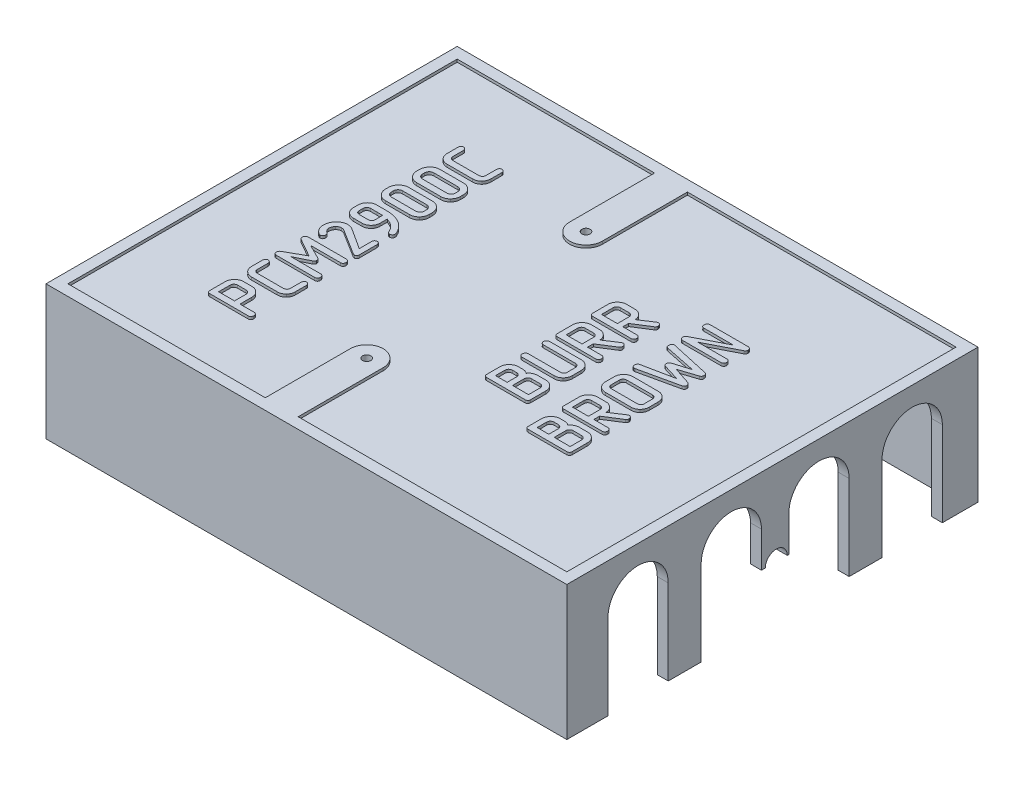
from build123d import *

# Parameters (mm, degrees)
SKETCH_1_W               = 95
SKETCH_1_H               = 75
EXTRUDE_1_DEPTH          = 24
SHELL_1_T                = -2
CUT_EXTRUDE_1_REACH      = 106.915
CUT_EXTRUDE_3_REACH      = 106.915
CUT_EXTRUDE_5_REACH      = 67.104
SKETCH_6_R               = 0.75
SKETCH_4_W               = 95
SKETCH_4_H               = 75
EXTRUDE_3_DEPTH          = 0.5
EXTRUDE_2_DEPTH          = 0.5
CUT_EXTRUDE_START        = -41.5
CUT_EXTRUDE_6_DEPTH      = 12
CUT_EXTRUDE_7_DEPTH      = 66.103763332
CUT_EXTRUDE_7_DEPTH_BACK = 66.103763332
SKETCH_6_2_R             = 0.75


with BuildPart() as part:
    # Sketch 1 → Extrude 1 (new body)
    with BuildSketch(Plane(origin=(0, 0, 0), x_dir=(1, 0, 0), z_dir=(0, 1, 0))):
        Rectangle(SKETCH_1_W, SKETCH_1_H)
    extrude(amount=EXTRUDE_1_DEPTH)

    # Shell 1
    shell_1_openings = [part.faces().sort_by_distance(p)[0] for p in [
        (0, 0, 0),
    ]]
    offset(amount=SHELL_1_T, openings=shell_1_openings, kind=Kind.INTERSECTION)

    # Sketch 2 → Cut-Extrude 1 (cut, up to next)
    with BuildSketch(Plane(origin=(47.5, 0, 0), x_dir=(0, 0, -1), z_dir=(1, 0, 0)), mode=Mode.PRIVATE) as cut_extrude_1_sk1:
        with BuildLine():
            Line((-30, 15.5), (-30, 0))
            Line((-30, 0), (-19, 0))
            Line((-19, 0), (-19, 15.5))
            ThreePointArc((-19, 15.5), (-24.5, 21), (-30, 15.5))
        make_face()
    cut_extrude_1_tool1 = extrude(cut_extrude_1_sk1.sketch, amount=-CUT_EXTRUDE_1_REACH, mode=Mode.PRIVATE) & part.part
    # Sketch 2 → Cut-Extrude 1 (cut, up to next)
    with BuildSketch(Plane(origin=(47.5, 0, 0), x_dir=(0, 0, -1), z_dir=(1, 0, 0)), mode=Mode.PRIVATE) as cut_extrude_1_sk2:
        with BuildLine():
            Line((-13, 15.5), (-13, 0))
            Line((-13, 0), (-2, 0))
            Line((-2, 0), (-2, 15.5))
            ThreePointArc((-2, 15.5), (-7.5, 21), (-13, 15.5))
        make_face()
    cut_extrude_1_tool2 = extrude(cut_extrude_1_sk2.sketch, amount=-CUT_EXTRUDE_1_REACH, mode=Mode.PRIVATE) & part.part
    # Sketch 2 → Cut-Extrude 1 (cut, up to next)
    with BuildSketch(Plane(origin=(47.5, 0, 0), x_dir=(0, 0, -1), z_dir=(1, 0, 0)), mode=Mode.PRIVATE) as cut_extrude_1_sk3:
        with BuildLine():
            Line((3, 15.5), (3, 0))
            Line((3, 0), (14, 0))
            Line((14, 0), (14, 15.5))
            ThreePointArc((14, 15.5), (8.5, 21), (3, 15.5))
        make_face()
    cut_extrude_1_tool3 = extrude(cut_extrude_1_sk3.sketch, amount=-CUT_EXTRUDE_1_REACH, mode=Mode.PRIVATE) & part.part
    # Sketch 2 → Cut-Extrude 1 (cut, up to next)
    with BuildSketch(Plane(origin=(47.5, 0, 0), x_dir=(0, 0, -1), z_dir=(1, 0, 0)), mode=Mode.PRIVATE) as cut_extrude_1_sk4:
        with BuildLine():
            Line((20, 15.5), (20, 0))
            Line((20, 0), (31, 0))
            Line((31, 0), (31, 15.5))
            ThreePointArc((31, 15.5), (25.5, 21), (20, 15.5))
        make_face()
    cut_extrude_1_tool4 = extrude(cut_extrude_1_sk4.sketch, amount=-CUT_EXTRUDE_1_REACH, mode=Mode.PRIVATE) & part.part
    add(cut_extrude_1_tool1.solids().sort_by_distance((47.5, 9.947861, 24.5))[0], mode=Mode.SUBTRACT)
    add(cut_extrude_1_tool2.solids().sort_by_distance((47.5, 9.947861, 7.5))[0], mode=Mode.SUBTRACT)
    add(cut_extrude_1_tool3.solids().sort_by_distance((47.5, 9.947861, -8.5))[0], mode=Mode.SUBTRACT)
    add(cut_extrude_1_tool4.solids().sort_by_distance((47.5, 9.947861, -25.5))[0], mode=Mode.SUBTRACT)

    # Sketch 3 → Cut-Extrude 3 (cut, up to next)
    with BuildSketch(Plane(origin=(47.5, 0, 0), x_dir=(0, 0, -1), z_dir=(1, 0, 0)), mode=Mode.PRIVATE) as cut_extrude_3_sk1:
        with BuildLine():
            Line((2.7, 9), (3, 9))
            Line((3, 9), (3, 0))
            Line((3, 0), (-2, 0))
            Line((-2, 0), (-2, 9))
            Line((-2, 9), (-1.3, 9))
            ThreePointArc((-1.3, 9), (0.7, 11), (2.7, 9))
        make_face()
    cut_extrude_3_tool1 = extrude(cut_extrude_3_sk1.sketch, amount=-CUT_EXTRUDE_3_REACH, mode=Mode.PRIVATE) & part.part
    add(cut_extrude_3_tool1.solids().sort_by_distance((47.5, 5.155335, -0.524504))[0], mode=Mode.SUBTRACT)

    # Sketch 6 → Cut-Extrude 5 (cut, up to next)
    with BuildSketch(Plane(origin=(0, 24, 0), x_dir=(1, 0, 0), z_dir=(0, 1, 0)), mode=Mode.PRIVATE) as cut_extrude_5_sk1:
        with Locations(Location((-6.5, 20, 0), (0, 0, 270))):
            Circle(SKETCH_6_R)
    cut_extrude_5_tool1 = extrude(cut_extrude_5_sk1.sketch, amount=-CUT_EXTRUDE_5_REACH, mode=Mode.PRIVATE) & part.part
    # Sketch 6 → Cut-Extrude 5 (cut, up to next)
    with BuildSketch(Plane(origin=(0, 24, 0), x_dir=(1, 0, 0), z_dir=(0, 1, 0)), mode=Mode.PRIVATE) as cut_extrude_5_sk2:
        with Locations(Location((-6.5, -20, 0), (0, 0, 270))):
            Circle(SKETCH_6_R)
    cut_extrude_5_tool2 = extrude(cut_extrude_5_sk2.sketch, amount=-CUT_EXTRUDE_5_REACH, mode=Mode.PRIVATE) & part.part
    add(cut_extrude_5_tool1.solids().sort_by_distance((-6.5, 24, -20))[0], mode=Mode.SUBTRACT)
    add(cut_extrude_5_tool2.solids().sort_by_distance((-6.5, 24, 20))[0], mode=Mode.SUBTRACT)

    # Sketch 4 → Extrude 3 (add)
    with BuildSketch(Plane(origin=(0, 24, 0), x_dir=(1, 0, 0), z_dir=(0, 1, 0))):
        Rectangle(SKETCH_4_W, SKETCH_4_H)
        with BuildLine():
            Line((45.5, 35.5), (-3.5, 35.5))
            Line((-3.5, 35.5), (-3.5, 20))
            ThreePointArc((-3.5, 20), (-6.5, 17), (-9.5, 20))
            Line((-9.5, 20), (-9.5, 35.5))
            Line((-9.5, 35.5), (-45.5, 35.5))
            Line((-45.5, 35.5), (-45.5, -35.5))
            Line((-45.5, -35.5), (-9.5, -35.5))
            Line((-9.5, -35.5), (-9.5, -20))
            ThreePointArc((-9.5, -20), (-6.5, -17), (-3.5, -20))
            Line((-3.5, -20), (-3.5, -35.5))
            Line((-3.5, -35.5), (45.5, -35.5))
            Line((45.5, -35.5), (45.5, 35.5))
        make_face(mode=Mode.SUBTRACT)
    extrude(amount=EXTRUDE_3_DEPTH)

    # Sketch 7 → Extrude 2 (add)
    # profile 1 of 17: a face of its own
    with BuildSketch(Plane(origin=(0, 24, 0), x_dir=(1, 0, 0), z_dir=(0, 1, 0))):
        with BuildLine():
            add(Edge.make_bspline(
                [(-23.5, 21.588926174), (-23.501520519, 21.637234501), (-23.504388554, 21.728354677), (-23.536479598, 21.855370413), (-23.589925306, 21.962706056), (-23.666066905, 22.045031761), (-23.748690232, 22.106679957), (-23.831058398, 22.154042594), (-23.912834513, 22.184820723), (-23.968449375, 22.188055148), (-23.994966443, 22.189597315)],
                knots=[0, 0, 0, 0, 1.338544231, 2.524790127, 3.608106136, 4.630632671, 5.605730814, 6.46082919, 7.266126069, 8, 8, 8, 8], degree=3))
            add(Edge.make_bspline(
                [(-23.994966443, 22.189597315), (-24.02427003, 22.18814103), (-24.083021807, 22.185221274), (-24.16954125, 22.155788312), (-24.253012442, 22.109907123), (-24.334462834, 22.048634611), (-24.404779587, 21.965742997), (-24.453523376, 21.858565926), (-24.483607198, 21.730944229), (-24.486638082, 21.638333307), (-24.488255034, 21.588926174)],
                knots=[0, 0, 0, 0, 0.805340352, 1.614654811, 2.490670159, 3.424974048, 4.409924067, 5.451174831, 6.640223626, 8, 8, 8, 8], degree=3))
            Line((-24.488255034, 21.588926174), (-24.488255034, 19.64261745))
            add(Edge.make_bspline(
                [(-24.488255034, 19.64261745), (-24.490500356, 19.607624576), (-24.494953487, 19.538223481), (-24.531966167, 19.437620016), (-24.587171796, 19.340978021), (-24.666535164, 19.253232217), (-24.764006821, 19.176311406), (-24.882337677, 19.120117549), (-25.019133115, 19.089102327), (-25.115615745, 19.084580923), (-25.166107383, 19.082214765)],
                knots=[0, 0, 0, 0, 0.856413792, 1.698518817, 2.602555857, 3.574870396, 4.582487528, 5.632318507, 6.760936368, 8, 8, 8, 8], degree=3))
            Line((-25.166107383, 19.082214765), (-29.833892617, 19.082214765))
            add(Edge.make_bspline(
                [(-29.833892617, 19.082214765), (-29.883819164, 19.084584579), (-29.979185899, 19.089111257), (-30.114449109, 19.120054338), (-30.230788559, 19.176550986), (-30.327827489, 19.252612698), (-30.401241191, 19.343512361), (-30.459537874, 19.437805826), (-30.492257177, 19.539329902), (-30.497427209, 19.608296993), (-30.5, 19.64261745)],
                knots=[0, 0, 0, 0, 1.236899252, 2.362651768, 3.409870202, 4.416049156, 5.38994518, 6.290517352, 7.149301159, 8, 8, 8, 8], degree=3))
            Line((-30.5, 19.64261745), (-30.5, 21.588926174))
            add(Edge.make_bspline(
                [(-30.5, 21.588926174), (-30.501520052, 21.637235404), (-30.504387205, 21.728357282), (-30.536484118, 21.855361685), (-30.589910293, 21.962735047), (-30.666118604, 22.044931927), (-30.748908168, 22.107311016), (-30.83201563, 22.153176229), (-30.913268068, 22.185105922), (-30.968418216, 22.188137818), (-30.994966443, 22.189597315)],
                knots=[0, 0, 0, 0, 1.338726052, 2.525133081, 3.608596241, 4.631261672, 5.606492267, 6.475274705, 7.266026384, 8, 8, 8, 8], degree=3))
            add(Edge.make_bspline(
                [(-30.994966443, 22.189597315), (-31.02427874, 22.188127), (-31.083582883, 22.185152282), (-31.170662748, 22.155462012), (-31.256972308, 22.112160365), (-31.338635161, 22.049735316), (-31.414389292, 21.969595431), (-31.46289921, 21.860569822), (-31.496131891, 21.732414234), (-31.498650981, 21.638968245), (-31.5, 21.588926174)],
                knots=[0, 0, 0, 0, 0.797207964, 1.612897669, 2.486488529, 3.423490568, 4.406937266, 5.458032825, 6.638729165, 8, 8, 8, 8], degree=3))
            Line((-31.5, 21.588926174), (-31.5, 19.64261745))
            add(Edge.make_bspline(
                [(-31.5, 19.64261745), (-31.498146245, 19.585514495), (-31.494515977, 19.47368794), (-31.473035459, 19.308705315), (-31.43345922, 19.151275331), (-31.382256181, 18.998737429), (-31.312655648, 18.853922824), (-31.227494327, 18.716182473), (-31.131114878, 18.582172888), (-31.016368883, 18.460119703), (-30.893833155, 18.345513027), (-30.760803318, 18.247323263), (-30.623013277, 18.161736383), (-30.47697254, 18.095116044), (-30.325665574, 18.040739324), (-30.167736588, 18.001980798), (-30.002840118, 17.980267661), (-29.891001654, 17.976669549), (-29.833892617, 17.974832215)],
                knots=[0, 0, 0, 0, 1.04470388, 2.045877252, 3.035855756, 4.009633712, 4.984271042, 5.966768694, 6.969352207, 7.997445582, 9.025538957, 10.0342103, 11.016707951, 11.986986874, 12.964144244, 13.954122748, 14.95529612, 16, 16, 16, 16], degree=3))
            Line((-29.833892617, 17.974832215), (-25.166107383, 17.974832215))
            add(Edge.make_bspline(
                [(-25.166107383, 17.974832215), (-25.108443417, 17.976701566), (-24.994944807, 17.980380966), (-24.827782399, 18.001795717), (-24.667638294, 18.040732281), (-24.514706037, 18.095171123), (-24.367243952, 18.161267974), (-24.229238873, 18.247459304), (-24.095760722, 18.345161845), (-24.015397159, 18.422414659), (-23.974832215, 18.461409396)],
                knots=[0, 0, 0, 0, 1.046818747, 2.060428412, 3.052666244, 4.031888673, 5.003928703, 5.978879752, 6.97980345, 8, 8, 8, 8], degree=3))
            add(Edge.make_bspline(
                [(-23.974832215, 18.461409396), (-23.937098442, 18.502095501), (-23.862069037, 18.58299529), (-23.765312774, 18.715202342), (-23.684189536, 18.854517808), (-23.616446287, 18.999096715), (-23.564080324, 19.150967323), (-23.52822326, 19.309141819), (-23.502638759, 19.473447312), (-23.500891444, 19.585467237), (-23.5, 19.64261745)],
                knots=[0, 0, 0, 0, 1.018507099, 2.025187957, 3.001163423, 3.975407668, 4.953165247, 5.9447985, 6.951479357, 8, 8, 8, 8], degree=3))
            Line((-23.5, 19.64261745), (-23.5, 21.588926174))
        make_face()
    # profile 2 of 17: a face of its own
    with BuildSketch(Plane(origin=(0, 24, 0), x_dir=(1, 0, 0), z_dir=(0, 1, 0))):
        with BuildLine():
            Line((-25.315436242, 16.498322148), (-29.674496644, 16.498322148))
            add(Edge.make_bspline(
                [(-29.674496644, 16.498322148), (-29.734423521, 16.496730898), (-29.852581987, 16.493593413), (-30.027095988, 16.46798881), (-30.195578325, 16.423864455), (-30.359110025, 16.3631102), (-30.517302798, 16.285935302), (-30.669014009, 16.190681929), (-30.816056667, 16.080058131), (-30.952992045, 15.950748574), (-31.082798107, 15.812308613), (-31.192761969, 15.660145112), (-31.288494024, 15.501329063), (-31.365452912, 15.332844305), (-31.426056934, 15.155797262), (-31.46998995, 14.970471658), (-31.495283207, 14.776433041), (-31.498409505, 14.644368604), (-31.5, 14.577181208)],
                knots=[0, 0, 0, 0, 0.975884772, 1.924162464, 2.865500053, 3.808115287, 4.761543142, 5.727253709, 6.72213282, 7.753590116, 8.791744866, 9.80853288, 10.805370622, 11.808185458, 12.819448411, 13.849214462, 14.905794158, 16, 16, 16, 16], degree=3))
            Line((-31.5, 14.577181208), (-31.5, 14.110738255))
            add(Edge.make_bspline(
                [(-31.5, 14.110738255), (-31.498401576, 14.04913829), (-31.495249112, 13.927648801), (-31.469736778, 13.748099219), (-31.425633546, 13.575931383), (-31.366946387, 13.408984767), (-31.289315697, 13.250380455), (-31.195956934, 13.097290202), (-31.085327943, 12.950958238), (-30.999788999, 12.861061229), (-30.956375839, 12.815436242)],
                knots=[0, 0, 0, 0, 1.024038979, 2.019643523, 3.007574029, 3.97533876, 4.956945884, 5.937847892, 6.953406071, 8, 8, 8, 8], degree=3))
            add(Edge.make_bspline(
                [(-30.956375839, 12.815436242), (-30.911847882, 12.77316433), (-30.823568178, 12.68935739), (-30.679542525, 12.580869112), (-30.528115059, 12.489185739), (-30.371168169, 12.413259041), (-30.205912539, 12.356122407), (-30.035236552, 12.314260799), (-29.857066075, 12.288104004), (-29.736108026, 12.2850915), (-29.674496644, 12.283557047)],
                knots=[0, 0, 0, 0, 1.032819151, 2.047634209, 3.027619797, 4.00868994, 4.976298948, 5.964927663, 6.963412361, 8, 8, 8, 8], degree=3))
            Line((-29.674496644, 12.283557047), (-25.315436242, 12.283557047))
            add(Edge.make_bspline(
                [(-25.315436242, 12.283557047), (-25.252712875, 12.285110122), (-25.129540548, 12.288159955), (-24.948501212, 12.313987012), (-24.775250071, 12.356546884), (-24.607815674, 12.412400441), (-24.449840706, 12.48976317), (-24.297182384, 12.580290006), (-24.152985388, 12.689432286), (-24.06467677, 12.773189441), (-24.020134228, 12.815436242)],
                knots=[0, 0, 0, 0, 1.045924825, 2.05392348, 3.042743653, 4.019296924, 4.991562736, 5.970741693, 6.976449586, 8, 8, 8, 8], degree=3))
            add(Edge.make_bspline(
                [(-24.020134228, 12.815436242), (-23.978305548, 12.859885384), (-23.89558208, 12.94779127), (-23.790225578, 13.093127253), (-23.70055915, 13.245457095), (-23.626124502, 13.404075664), (-23.571458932, 13.571296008), (-23.528144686, 13.743642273), (-23.505196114, 13.924999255), (-23.501753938, 14.048042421), (-23.5, 14.110738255)],
                knots=[0, 0, 0, 0, 1.021212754, 2.019625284, 2.997803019, 3.978309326, 4.946754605, 5.939396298, 6.950032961, 8, 8, 8, 8], degree=3))
            Line((-23.5, 14.110738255), (-23.5, 14.577181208))
            add(Edge.make_bspline(
                [(-23.5, 14.577181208), (-23.501761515, 14.645461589), (-23.505208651, 14.77908057), (-23.527785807, 14.974973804), (-23.571378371, 15.159575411), (-23.625083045, 15.336086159), (-23.700226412, 15.500713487), (-23.789845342, 15.656447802), (-23.894634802, 15.803559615), (-23.97818677, 15.890776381), (-24.020134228, 15.934563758)],
                knots=[0, 0, 0, 0, 1.097335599, 2.147393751, 3.161174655, 4.14174761, 5.107171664, 6.061361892, 7.026702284, 8, 8, 8, 8], degree=3))
            add(Edge.make_bspline(
                [(-24.020134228, 15.934563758), (-24.067460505, 15.979627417), (-24.159857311, 16.067606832), (-24.309371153, 16.182688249), (-24.463483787, 16.280638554), (-24.624121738, 16.359557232), (-24.788983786, 16.422713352), (-24.960234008, 16.465840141), (-25.136088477, 16.493982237), (-25.255484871, 16.496871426), (-25.315436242, 16.498322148)],
                knots=[0, 0, 0, 0, 1.079886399, 2.108301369, 3.114014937, 4.094149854, 5.062832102, 6.027267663, 7.009450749, 8, 8, 8, 8], degree=3))
        make_face()
        with BuildLine():
            add(Edge.make_bspline(
                [(-25.315436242, 15.402684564), (-25.260325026, 15.399872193), (-25.152057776, 15.394347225), (-24.995851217, 15.347770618), (-24.854586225, 15.267806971), (-24.727822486, 15.163124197), (-24.623097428, 15.036360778), (-24.54356202, 14.895522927), (-24.496364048, 14.740079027), (-24.4909994, 14.63231137), (-24.488255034, 14.577181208)],
                knots=[0, 0, 0, 0, 1.018588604, 2.001040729, 2.983220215, 4.004959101, 5.026697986, 6.008877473, 6.981411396, 8, 8, 8, 8], degree=3))
            Line((-24.488255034, 14.577181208), (-24.488255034, 14.110738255))
            add(Edge.make_bspline(
                [(-24.488255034, 14.110738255), (-24.490612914, 14.066738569), (-24.495386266, 13.977664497), (-24.542351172, 13.848857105), (-24.614561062, 13.725598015), (-24.712908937, 13.611541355), (-24.833178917, 13.511704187), (-24.978452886, 13.442248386), (-25.140445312, 13.39694953), (-25.255826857, 13.392986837), (-25.315436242, 13.390939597)],
                knots=[0, 0, 0, 0, 0.865121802, 1.75137437, 2.671061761, 3.672736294, 4.708351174, 5.729762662, 6.827130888, 8, 8, 8, 8], degree=3))
            Line((-25.315436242, 13.390939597), (-29.674496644, 13.390939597))
            add(Edge.make_bspline(
                [(-29.674496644, 13.390939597), (-29.734113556, 13.392940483), (-29.84896854, 13.396795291), (-30.011088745, 13.442588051), (-30.156073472, 13.513140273), (-30.276896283, 13.613242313), (-30.375750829, 13.726761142), (-30.445157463, 13.850632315), (-30.49320943, 13.978069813), (-30.497745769, 14.066696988), (-30.5, 14.110738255)],
                knots=[0, 0, 0, 0, 1.174601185, 2.262928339, 3.300661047, 4.337805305, 5.340959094, 6.256486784, 7.133600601, 8, 8, 8, 8], degree=3))
            Line((-30.5, 14.110738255), (-30.5, 14.577181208))
            add(Edge.make_bspline(
                [(-30.5, 14.577181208), (-30.497180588, 14.6317494), (-30.491613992, 14.739487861), (-30.444710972, 14.894574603), (-30.367143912, 15.036857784), (-30.261942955, 15.162974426), (-30.135142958, 15.268420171), (-29.993149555, 15.346946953), (-29.837437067, 15.394650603), (-29.729641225, 15.399965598), (-29.674496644, 15.402684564)],
                knots=[0, 0, 0, 0, 1.009066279, 1.99228238, 2.970246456, 3.992779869, 5.015313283, 6.00732913, 6.980619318, 8, 8, 8, 8], degree=3))
            Line((-29.674496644, 15.402684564), (-25.315436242, 15.402684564))
        make_face(mode=Mode.SUBTRACT)
    # profile 3 of 17: a face of its own
    with BuildSketch(Plane(origin=(0, 24, 0), x_dir=(1, 0, 0), z_dir=(0, 1, 0))):
        with BuildLine():
            Line((-25.315436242, 10.80704698), (-29.674496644, 10.80704698))
            add(Edge.make_bspline(
                [(-29.674496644, 10.80704698), (-29.734423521, 10.80545573), (-29.852581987, 10.802318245), (-30.027095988, 10.776713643), (-30.195578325, 10.732589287), (-30.359110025, 10.671835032), (-30.517302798, 10.594660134), (-30.669014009, 10.499406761), (-30.816056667, 10.388782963), (-30.952992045, 10.259473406), (-31.082798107, 10.121033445), (-31.192761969, 9.968869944), (-31.288494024, 9.810053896), (-31.365452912, 9.641569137), (-31.426056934, 9.464522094), (-31.46998995, 9.27919649), (-31.495283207, 9.085157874), (-31.498409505, 8.953093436), (-31.5, 8.88590604)],
                knots=[0, 0, 0, 0, 0.975884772, 1.924162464, 2.865500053, 3.808115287, 4.761543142, 5.727253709, 6.72213282, 7.753590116, 8.791744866, 9.80853288, 10.805370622, 11.808185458, 12.819448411, 13.849214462, 14.905794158, 16, 16, 16, 16], degree=3))
            Line((-31.5, 8.88590604), (-31.5, 8.419463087))
            add(Edge.make_bspline(
                [(-31.5, 8.419463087), (-31.498401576, 8.357863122), (-31.495249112, 8.236373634), (-31.469736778, 8.056824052), (-31.425633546, 7.884656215), (-31.366946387, 7.717709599), (-31.289315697, 7.559105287), (-31.195956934, 7.406015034), (-31.085327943, 7.25968307), (-30.999788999, 7.169786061), (-30.956375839, 7.124161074)],
                knots=[0, 0, 0, 0, 1.024038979, 2.019643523, 3.007574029, 3.97533876, 4.956945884, 5.937847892, 6.953406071, 8, 8, 8, 8], degree=3))
            add(Edge.make_bspline(
                [(-30.956375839, 7.124161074), (-30.911847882, 7.081889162), (-30.823568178, 6.998082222), (-30.679542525, 6.889593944), (-30.528115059, 6.797910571), (-30.371168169, 6.721983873), (-30.205912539, 6.664847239), (-30.035236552, 6.622985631), (-29.857066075, 6.596828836), (-29.736108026, 6.593816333), (-29.674496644, 6.592281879)],
                knots=[0, 0, 0, 0, 1.032819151, 2.047634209, 3.027619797, 4.00868994, 4.976298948, 5.964927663, 6.963412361, 8, 8, 8, 8], degree=3))
            Line((-29.674496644, 6.592281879), (-25.315436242, 6.592281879))
            add(Edge.make_bspline(
                [(-25.315436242, 6.592281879), (-25.252712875, 6.593834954), (-25.129540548, 6.596884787), (-24.948501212, 6.622711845), (-24.775250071, 6.665271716), (-24.607815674, 6.721125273), (-24.449840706, 6.798488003), (-24.297182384, 6.889014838), (-24.152985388, 6.998157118), (-24.06467677, 7.081914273), (-24.020134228, 7.124161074)],
                knots=[0, 0, 0, 0, 1.045924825, 2.05392348, 3.042743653, 4.019296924, 4.991562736, 5.970741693, 6.976449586, 8, 8, 8, 8], degree=3))
            add(Edge.make_bspline(
                [(-24.020134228, 7.124161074), (-23.978305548, 7.168610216), (-23.89558208, 7.256516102), (-23.790225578, 7.401852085), (-23.70055915, 7.554181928), (-23.626124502, 7.712800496), (-23.571458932, 7.88002084), (-23.528144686, 8.052367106), (-23.505196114, 8.233724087), (-23.501753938, 8.356767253), (-23.5, 8.419463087)],
                knots=[0, 0, 0, 0, 1.021212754, 2.019625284, 2.997803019, 3.978309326, 4.946754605, 5.939396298, 6.950032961, 8, 8, 8, 8], degree=3))
            Line((-23.5, 8.419463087), (-23.5, 8.88590604))
            add(Edge.make_bspline(
                [(-23.5, 8.88590604), (-23.501761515, 8.954186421), (-23.505208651, 9.087805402), (-23.527785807, 9.283698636), (-23.571378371, 9.468300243), (-23.625083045, 9.644810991), (-23.700226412, 9.809438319), (-23.789845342, 9.965172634), (-23.894634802, 10.112284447), (-23.97818677, 10.199501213), (-24.020134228, 10.243288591)],
                knots=[0, 0, 0, 0, 1.097335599, 2.147393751, 3.161174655, 4.14174761, 5.107171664, 6.061361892, 7.026702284, 8, 8, 8, 8], degree=3))
            add(Edge.make_bspline(
                [(-24.020134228, 10.243288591), (-24.067460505, 10.288352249), (-24.159857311, 10.376331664), (-24.309371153, 10.491413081), (-24.463483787, 10.589363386), (-24.624121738, 10.668282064), (-24.788983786, 10.731438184), (-24.960234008, 10.774564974), (-25.136088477, 10.802707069), (-25.255484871, 10.805596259), (-25.315436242, 10.80704698)],
                knots=[0, 0, 0, 0, 1.079886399, 2.108301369, 3.114014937, 4.094149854, 5.062832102, 6.027267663, 7.009450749, 8, 8, 8, 8], degree=3))
        make_face()
        with BuildLine():
            add(Edge.make_bspline(
                [(-25.315436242, 9.711409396), (-25.260325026, 9.708597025), (-25.152057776, 9.703072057), (-24.995851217, 9.65649545), (-24.854586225, 9.576531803), (-24.727822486, 9.471849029), (-24.623097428, 9.34508561), (-24.54356202, 9.20424776), (-24.496364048, 9.048803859), (-24.4909994, 8.941036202), (-24.488255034, 8.88590604)],
                knots=[0, 0, 0, 0, 1.018588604, 2.001040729, 2.983220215, 4.004959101, 5.026697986, 6.008877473, 6.981411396, 8, 8, 8, 8], degree=3))
            Line((-24.488255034, 8.88590604), (-24.488255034, 8.419463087))
            add(Edge.make_bspline(
                [(-24.488255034, 8.419463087), (-24.490612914, 8.375463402), (-24.495386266, 8.28638933), (-24.542351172, 8.157581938), (-24.614561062, 8.034322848), (-24.712908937, 7.920266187), (-24.833178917, 7.820429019), (-24.978452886, 7.750973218), (-25.140445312, 7.705674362), (-25.255826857, 7.701711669), (-25.315436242, 7.69966443)],
                knots=[0, 0, 0, 0, 0.865121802, 1.75137437, 2.671061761, 3.672736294, 4.708351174, 5.729762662, 6.827130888, 8, 8, 8, 8], degree=3))
            Line((-25.315436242, 7.69966443), (-29.674496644, 7.69966443))
            add(Edge.make_bspline(
                [(-29.674496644, 7.69966443), (-29.734113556, 7.701665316), (-29.84896854, 7.705520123), (-30.011088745, 7.751312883), (-30.156073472, 7.821865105), (-30.276896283, 7.921967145), (-30.375750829, 8.035485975), (-30.445157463, 8.159357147), (-30.49320943, 8.286794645), (-30.497745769, 8.37542182), (-30.5, 8.419463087)],
                knots=[0, 0, 0, 0, 1.174601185, 2.262928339, 3.300661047, 4.337805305, 5.340959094, 6.256486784, 7.133600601, 8, 8, 8, 8], degree=3))
            Line((-30.5, 8.419463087), (-30.5, 8.88590604))
            add(Edge.make_bspline(
                [(-30.5, 8.88590604), (-30.497180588, 8.940474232), (-30.491613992, 9.048212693), (-30.444710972, 9.203299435), (-30.367143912, 9.345582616), (-30.261942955, 9.471699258), (-30.135142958, 9.577145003), (-29.993149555, 9.655671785), (-29.837437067, 9.703375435), (-29.729641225, 9.70869043), (-29.674496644, 9.711409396)],
                knots=[0, 0, 0, 0, 1.009066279, 1.99228238, 2.970246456, 3.992779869, 5.015313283, 6.00732913, 6.980619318, 8, 8, 8, 8], degree=3))
            Line((-29.674496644, 9.711409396), (-25.315436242, 9.711409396))
        make_face(mode=Mode.SUBTRACT)
    # profile 4 of 17: a face of its own
    with BuildSketch(Plane(origin=(0, 24, 0), x_dir=(1, 0, 0), z_dir=(0, 1, 0))):
        with BuildLine():
            add(Edge.make_bspline(
                [(-26.60738255, 3.872483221), (-26.601645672, 3.864734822), (-26.587588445, 3.845748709), (-26.54850329, 3.826908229), (-26.499762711, 3.798027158), (-26.408724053, 3.765383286), (-26.287121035, 3.72035442), (-26.188447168, 3.681913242), (-26.139261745, 3.662751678)],
                knots=[0, 0, 0, 0, 0.331666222, 0.812690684, 1.474878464, 2.313935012, 4.162627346, 6, 6, 6, 6], degree=3))
            add(Edge.make_bspline(
                [(-26.139261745, 3.662751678), (-26.043358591, 3.620262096), (-25.853476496, 3.536135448), (-25.585421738, 3.381345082), (-25.339174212, 3.200483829), (-25.114503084, 2.996892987), (-24.910365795, 2.774552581), (-24.734604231, 2.530532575), (-24.579300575, 2.272115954), (-24.498609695, 2.087670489), (-24.458053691, 1.994966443)],
                knots=[0, 0, 0, 0, 1.033996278, 2.047246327, 3.045674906, 4.041540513, 5.033319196, 6.016331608, 7.002989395, 8, 8, 8, 8], degree=3))
            add(Edge.make_bspline(
                [(-24.458053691, 1.994966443), (-24.447597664, 1.969451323), (-24.427598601, 1.920648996), (-24.386548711, 1.854706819), (-24.336078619, 1.800850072), (-24.259322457, 1.745360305), (-24.152600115, 1.697526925), (-24.061474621, 1.689955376), (-24.016778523, 1.686241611)],
                knots=[0, 0, 0, 0, 0.86173907, 1.648233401, 2.415811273, 3.154313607, 4.604220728, 6, 6, 6, 6], degree=3))
            add(Edge.make_bspline(
                [(-24.016778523, 1.686241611), (-23.98422036, 1.687928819), (-23.91923881, 1.691296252), (-23.824376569, 1.716109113), (-23.737594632, 1.762770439), (-23.65526952, 1.819192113), (-23.58750392, 1.892983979), (-23.534967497, 1.975894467), (-23.505742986, 2.070285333), (-23.501954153, 2.135716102), (-23.5, 2.169463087)],
                knots=[0, 0, 0, 0, 0.994793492, 1.985468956, 2.963686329, 3.992676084, 5.020388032, 6.002180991, 6.969592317, 8, 8, 8, 8], degree=3))
            add(Edge.make_bspline(
                [(-23.5, 2.169463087), (-23.501272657, 2.221029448), (-23.503633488, 2.316687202), (-23.539046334, 2.405412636), (-23.555369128, 2.446308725)],
                knots=[0, 0, 0, 0, 1.078142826, 2, 2, 2, 2], degree=3))
            add(Edge.make_bspline(
                [(-23.555369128, 2.446308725), (-23.611002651, 2.572293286), (-23.721272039, 2.822003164), (-23.931023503, 3.173522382), (-24.173076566, 3.501872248), (-24.448050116, 3.804160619), (-24.746739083, 4.077678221), (-25.063336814, 4.319959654), (-25.398055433, 4.524923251), (-25.634161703, 4.632632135), (-25.751677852, 4.686241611)],
                knots=[0, 0, 0, 0, 1.026837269, 2.035260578, 3.0468565, 4.066135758, 5.079245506, 6.064962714, 7.036882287, 8, 8, 8, 8], degree=3))
            add(Edge.make_bspline(
                [(-25.751677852, 4.686241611), (-25.836348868, 4.720694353), (-26.005239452, 4.789416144), (-26.264703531, 4.876474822), (-26.527446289, 4.949928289), (-26.794414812, 5.011137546), (-27.065026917, 5.057523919), (-27.339924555, 5.091252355), (-27.618248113, 5.111926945), (-27.805334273, 5.114486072), (-27.899328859, 5.115771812)],
                knots=[0, 0, 0, 0, 0.994786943, 1.984269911, 2.976837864, 3.963320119, 4.964123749, 5.963834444, 6.977003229, 8, 8, 8, 8], degree=3))
            Line((-27.899328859, 5.115771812), (-29.833892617, 5.115771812))
            add(Edge.make_bspline(
                [(-29.833892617, 5.115771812), (-29.888217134, 5.11400985), (-29.996249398, 5.110505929), (-30.155613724, 5.087042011), (-30.310208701, 5.046115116), (-30.460356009, 4.988675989), (-30.606157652, 4.914416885), (-30.748073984, 4.825083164), (-30.884338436, 4.719038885), (-30.968799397, 4.638345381), (-31.011744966, 4.597315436)],
                knots=[0, 0, 0, 0, 0.985925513, 1.960657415, 2.915956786, 3.883047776, 4.872676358, 5.880871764, 6.92249427, 8, 8, 8, 8], degree=3))
            add(Edge.make_bspline(
                [(-31.011744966, 4.597315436), (-31.050670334, 4.556709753), (-31.127785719, 4.47626548), (-31.227356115, 4.342219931), (-31.311261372, 4.199147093), (-31.381221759, 4.046466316), (-31.434053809, 3.883602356), (-31.473420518, 3.711326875), (-31.49443729, 3.529601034), (-31.498121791, 3.405528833), (-31.5, 3.342281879)],
                knots=[0, 0, 0, 0, 0.974289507, 1.930173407, 2.886204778, 3.844984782, 4.835205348, 5.848876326, 6.903444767, 8, 8, 8, 8], degree=3))
            Line((-31.5, 3.342281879), (-31.5, 2.568791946))
            add(Edge.make_bspline(
                [(-31.5, 2.568791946), (-31.498146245, 2.511688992), (-31.494515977, 2.399862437), (-31.473035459, 2.234879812), (-31.43345922, 2.077449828), (-31.382256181, 1.924911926), (-31.312655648, 1.780097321), (-31.227494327, 1.64235697), (-31.131114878, 1.508347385), (-31.016368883, 1.386294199), (-30.893833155, 1.271687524), (-30.760803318, 1.173497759), (-30.623013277, 1.087910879), (-30.47697254, 1.021290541), (-30.325665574, 0.966913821), (-30.167736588, 0.928155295), (-30.002840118, 0.906442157), (-29.891001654, 0.902844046), (-29.833892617, 0.901006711)],
                knots=[0, 0, 0, 0, 1.04470388, 2.045877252, 3.035855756, 4.009633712, 4.984271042, 5.966768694, 6.969352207, 7.997445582, 9.025538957, 10.0342103, 11.016707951, 11.986986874, 12.964144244, 13.954122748, 14.95529612, 16, 16, 16, 16], degree=3))
            Line((-29.833892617, 0.901006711), (-28.273489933, 0.901006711))
            add(Edge.make_bspline(
                [(-28.273489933, 0.901006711), (-28.216387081, 0.902860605), (-28.104560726, 0.906491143), (-27.939576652, 0.927969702), (-27.782152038, 0.967553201), (-27.62959442, 1.018729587), (-27.484853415, 1.088429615), (-27.347217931, 1.172978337), (-27.214612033, 1.270492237), (-27.092598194, 1.384552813), (-26.978129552, 1.507216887), (-26.879685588, 1.64011633), (-26.794827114, 1.778492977), (-26.725095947, 1.92321403), (-26.673945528, 2.075779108), (-26.634152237, 2.233732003), (-26.612980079, 2.399320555), (-26.609268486, 2.511693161), (-26.60738255, 2.568791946)],
                knots=[0, 0, 0, 0, 1.044515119, 2.045507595, 3.035307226, 4.008909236, 4.983370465, 5.965690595, 6.959866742, 7.987774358, 9.015681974, 10.024171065, 11.006491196, 11.980952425, 12.954554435, 13.944354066, 14.955484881, 16, 16, 16, 16], degree=3))
            Line((-26.60738255, 2.568791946), (-26.60738255, 3.872483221))
        make_face()
        with BuildLine():
            Line((-27.60738255, 3.998322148), (-27.60738255, 2.568791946))
            add(Edge.make_bspline(
                [(-27.60738255, 2.568791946), (-27.608894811, 2.533768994), (-27.611896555, 2.4642506), (-27.649794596, 2.364254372), (-27.702648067, 2.267178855), (-27.780589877, 2.179481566), (-27.876315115, 2.102517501), (-27.993015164, 2.046289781), (-28.128173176, 2.015268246), (-28.22355532, 2.010753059), (-28.273489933, 2.008389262)],
                knots=[0, 0, 0, 0, 0.862256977, 1.711526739, 2.616399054, 3.587856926, 4.593145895, 5.639438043, 6.764194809, 8, 8, 8, 8], degree=3))
            Line((-28.273489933, 2.008389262), (-29.833892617, 2.008389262))
            add(Edge.make_bspline(
                [(-29.833892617, 2.008389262), (-29.883819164, 2.010759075), (-29.979185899, 2.015285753), (-30.114449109, 2.046228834), (-30.230788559, 2.102725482), (-30.327827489, 2.178787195), (-30.401241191, 2.269686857), (-30.459537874, 2.363980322), (-30.492257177, 2.465504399), (-30.497427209, 2.53447149), (-30.5, 2.568791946)],
                knots=[0, 0, 0, 0, 1.236899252, 2.362651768, 3.409870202, 4.416049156, 5.38994518, 6.290517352, 7.149301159, 8, 8, 8, 8], degree=3))
            Line((-30.5, 2.568791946), (-30.5, 3.342281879))
            add(Edge.make_bspline(
                [(-30.5, 3.342281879), (-30.497852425, 3.388358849), (-30.493672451, 3.47804165), (-30.457749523, 3.607173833), (-30.39494668, 3.722689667), (-30.313785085, 3.827459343), (-30.211578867, 3.911653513), (-30.096843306, 3.976330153), (-29.968762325, 4.014044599), (-29.879435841, 4.018077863), (-29.833892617, 4.020134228)],
                knots=[0, 0, 0, 0, 1.042310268, 2.028720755, 3.003188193, 4.004046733, 5.011056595, 5.980407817, 6.97030831, 8, 8, 8, 8], degree=3))
            add(Edge.make_bspline(
                [(-29.833892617, 4.020134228), (-29.710290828, 4.020134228), (-29.477069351, 4.020134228), (-29.148210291, 4.020134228), (-28.861856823, 4.020134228), (-28.685123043, 4.020134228), (-28.604026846, 4.020134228)],
                knots=[0, 0, 0, 0, 1.206002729, 2.275579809, 3.208731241, 4, 4, 4, 4], degree=3))
            add(Edge.make_bspline(
                [(-28.604026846, 4.020134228), (-28.536351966, 4.020342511), (-28.409389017, 4.020733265), (-28.232108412, 4.018207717), (-28.080504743, 4.017826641), (-27.953609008, 4.012757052), (-27.848941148, 4.012935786), (-27.764585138, 4.007787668), (-27.699021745, 4.007867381), (-27.63931527, 4.002446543), (-27.582795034, 3.999978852), (-27.541947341, 3.99883776), (-27.523489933, 3.998322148)],
                knots=[0, 0, 0, 0, 1.878198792, 3.523636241, 4.920729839, 6.085316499, 7.047824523, 7.82456037, 8.4301292, 8.86586104, 9.487528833, 10, 10, 10, 10], degree=3))
            Line((-27.523489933, 3.998322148), (-27.60738255, 3.998322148))
        make_face(mode=Mode.SUBTRACT)
    # profile 5 of 17: a face of its own
    with BuildSketch(Plane(origin=(0, 24, 0), x_dir=(1, 0, 0), z_dir=(0, 1, 0))):
        with BuildLine():
            add(Edge.make_bspline(
                [(-28.355704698, -0.874161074), (-28.435932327, -0.833586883), (-28.593734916, -0.753780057), (-28.841780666, -0.669882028), (-29.092454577, -0.619319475), (-29.260400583, -0.612468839), (-29.343959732, -0.609060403)],
                knots=[0, 0, 0, 0, 1.04272758, 2.050978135, 3.030291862, 4, 4, 4, 4], degree=3))
            add(Edge.make_bspline(
                [(-29.343959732, -0.609060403), (-29.413413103, -0.61160504), (-29.551360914, -0.61665918), (-29.755485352, -0.648414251), (-29.95367305, -0.70522412), (-30.14684803, -0.782154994), (-30.334078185, -0.881944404), (-30.515050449, -1.00464335), (-30.691038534, -1.1482792), (-30.800157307, -1.257936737), (-30.855704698, -1.313758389)],
                knots=[0, 0, 0, 0, 0.9710198, 1.928632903, 2.879069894, 3.847442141, 4.83025658, 5.838582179, 6.89972075, 8, 8, 8, 8], degree=3))
            add(Edge.make_bspline(
                [(-30.855704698, -1.313758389), (-30.907231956, -1.370374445), (-31.009251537, -1.482469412), (-31.140626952, -1.667190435), (-31.251634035, -1.862380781), (-31.343042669, -2.068566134), (-31.413342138, -2.285708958), (-31.463635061, -2.513786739), (-31.494447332, -2.752510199), (-31.49812811, -2.915455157), (-31.5, -2.998322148)],
                knots=[0, 0, 0, 0, 0.992146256, 1.96436507, 2.932435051, 3.900178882, 4.8842315, 5.887347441, 6.925593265, 8, 8, 8, 8], degree=3))
            add(Edge.make_bspline(
                [(-31.5, -2.998322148), (-31.496253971, -3.082478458), (-31.488814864, -3.249601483), (-31.434575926, -3.49734482), (-31.344932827, -3.737387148), (-31.222009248, -3.968836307), (-31.070696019, -4.184589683), (-30.895156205, -4.380947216), (-30.701797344, -4.559189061), (-30.556170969, -4.657252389), (-30.483221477, -4.706375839)],
                knots=[0, 0, 0, 0, 0.974558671, 1.935341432, 2.923526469, 3.93512126, 4.963347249, 5.96852999, 6.98236356, 8, 8, 8, 8], degree=3))
            add(Edge.make_bspline(
                [(-30.483221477, -4.706375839), (-30.440625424, -4.730424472), (-30.355602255, -4.77842636), (-30.258290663, -4.786326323), (-30.209731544, -4.790268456)],
                knots=[0, 0, 0, 0, 1.001986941, 2, 2, 2, 2], degree=3))
            add(Edge.make_bspline(
                [(-30.209731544, -4.790268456), (-30.175885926, -4.788551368), (-30.110090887, -4.785213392), (-30.017197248, -4.752653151), (-29.932045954, -4.703888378), (-29.861972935, -4.631982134), (-29.803088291, -4.55206228), (-29.757227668, -4.46676862), (-29.731440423, -4.376210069), (-29.728154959, -4.31446845), (-29.726510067, -4.283557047)],
                knots=[0, 0, 0, 0, 1.044743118, 2.030954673, 3.017470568, 4.058904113, 5.112374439, 6.088797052, 7.04314198, 8, 8, 8, 8], degree=3))
            add(Edge.make_bspline(
                [(-29.726510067, -4.283557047), (-29.729175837, -4.226195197), (-29.734098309, -4.12027381), (-29.775467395, -3.974488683), (-29.850020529, -3.857179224), (-29.922525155, -3.807768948), (-29.958053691, -3.783557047)],
                knots=[0, 0, 0, 0, 1.188517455, 2.194654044, 3.115348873, 4, 4, 4, 4], degree=3))
            add(Edge.make_bspline(
                [(-29.958053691, -3.783557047), (-30.002929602, -3.753156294), (-30.089526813, -3.694491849), (-30.203025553, -3.595282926), (-30.298866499, -3.494559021), (-30.374004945, -3.389422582), (-30.429194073, -3.280775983), (-30.470844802, -3.170809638), (-30.49477118, -3.05695263), (-30.498250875, -2.979971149), (-30.5, -2.941275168)],
                knots=[0, 0, 0, 0, 1.241699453, 2.396112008, 3.448523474, 4.423397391, 5.346731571, 6.235217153, 7.112903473, 8, 8, 8, 8], degree=3))
            add(Edge.make_bspline(
                [(-30.5, -2.941275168), (-30.495774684, -2.858083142), (-30.487513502, -2.695429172), (-30.423384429, -2.461011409), (-30.317046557, -2.244483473), (-30.214653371, -2.121210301), (-30.162751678, -2.058724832)],
                knots=[0, 0, 0, 0, 1.031453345, 2.016659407, 2.994672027, 4, 4, 4, 4], degree=3))
            add(Edge.make_bspline(
                [(-30.162751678, -2.058724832), (-30.107814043, -2.004607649), (-30.000537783, -1.898933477), (-29.805301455, -1.787187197), (-29.592711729, -1.715844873), (-29.443534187, -1.708462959), (-29.367449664, -1.704697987)],
                knots=[0, 0, 0, 0, 1.028650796, 2.008637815, 2.984352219, 4, 4, 4, 4], degree=3))
            add(Edge.make_bspline(
                [(-29.367449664, -1.704697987), (-29.323185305, -1.706574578), (-29.235254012, -1.710302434), (-29.104891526, -1.732212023), (-28.978449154, -1.770522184), (-28.898914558, -1.808267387), (-28.859060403, -1.827181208)],
                knots=[0, 0, 0, 0, 1.006824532, 2.000060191, 2.997846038, 4, 4, 4, 4], degree=3))
            Line((-28.859060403, -1.827181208), (-24.265100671, -4.708053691))
            add(Edge.make_bspline(
                [(-24.265100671, -4.708053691), (-24.235268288, -4.723988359), (-24.177615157, -4.754783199), (-24.087567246, -4.786044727), (-24.000484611, -4.807965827), (-23.942515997, -4.810737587), (-23.91442953, -4.812080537)],
                knots=[0, 0, 0, 0, 1.096694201, 2.119436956, 3.088845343, 4, 4, 4, 4], degree=3))
            add(Edge.make_bspline(
                [(-23.91442953, -4.812080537), (-23.881756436, -4.810763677), (-23.819785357, -4.808265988), (-23.733837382, -4.7815648), (-23.658419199, -4.742194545), (-23.600716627, -4.679850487), (-23.554591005, -4.604047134), (-23.520834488, -4.511919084), (-23.503846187, -4.402747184), (-23.501337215, -4.324996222), (-23.5, -4.283557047)],
                knots=[0, 0, 0, 0, 1.019727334, 1.934117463, 2.796706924, 3.651435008, 4.555702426, 5.564387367, 6.701883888, 8, 8, 8, 8], degree=3))
            Line((-23.5, -4.283557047), (-23.5, -1.176174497))
            add(Edge.make_bspline(
                [(-23.5, -1.176174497), (-23.501520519, -1.12786617), (-23.504388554, -1.036745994), (-23.536479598, -0.909730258), (-23.589925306, -0.802394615), (-23.666066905, -0.720068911), (-23.748690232, -0.658420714), (-23.831058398, -0.611058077), (-23.912834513, -0.580279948), (-23.968449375, -0.577045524), (-23.994966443, -0.575503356)],
                knots=[0, 0, 0, 0, 1.338544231, 2.524790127, 3.608106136, 4.630632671, 5.605730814, 6.46082919, 7.266126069, 8, 8, 8, 8], degree=3))
            add(Edge.make_bspline(
                [(-23.994966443, -0.575503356), (-24.02427003, -0.576959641), (-24.083021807, -0.579879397), (-24.16954125, -0.609312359), (-24.253012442, -0.655193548), (-24.334462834, -0.71646606), (-24.404779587, -0.799357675), (-24.453523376, -0.906534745), (-24.483607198, -1.034156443), (-24.486638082, -1.126767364), (-24.488255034, -1.176174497)],
                knots=[0, 0, 0, 0, 0.805340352, 1.614654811, 2.490670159, 3.424974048, 4.409924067, 5.451174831, 6.640223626, 8, 8, 8, 8], degree=3))
            Line((-24.488255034, -1.176174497), (-24.488255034, -3.374161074))
            Line((-24.488255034, -3.374161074), (-28.355704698, -0.874161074))
        make_face()
    # profile 6 of 17: a face of its own
    with BuildSketch(Plane(origin=(0, 24, 0), x_dir=(1, 0, 0), z_dir=(0, 1, 0))):
        with BuildLine():
            Line((-23.994966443, -6.197986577), (-30.959731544, -6.197986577))
            add(Edge.make_bspline(
                [(-30.959731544, -6.197986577), (-30.994618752, -6.19997295), (-31.063895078, -6.203917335), (-31.164951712, -6.23440172), (-31.26189178, -6.281714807), (-31.350950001, -6.347884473), (-31.428045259, -6.430337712), (-31.484607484, -6.529399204), (-31.516747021, -6.644045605), (-31.521174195, -6.724627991), (-31.523489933, -6.766778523)],
                knots=[0, 0, 0, 0, 0.937281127, 1.861180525, 2.816762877, 3.827948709, 4.8290078, 5.833115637, 6.866559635, 8, 8, 8, 8], degree=3))
            add(Edge.make_bspline(
                [(-31.523489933, -6.766778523), (-31.520331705, -6.813344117), (-31.514099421, -6.905234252), (-31.450880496, -7.033584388), (-31.352332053, -7.146959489), (-31.265660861, -7.204468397), (-31.219798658, -7.234899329)],
                knots=[0, 0, 0, 0, 0.949673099, 1.874035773, 2.875042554, 4, 4, 4, 4], degree=3))
            Line((-31.219798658, -7.234899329), (-27.926174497, -9.102348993))
            Line((-27.926174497, -9.102348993), (-31.219798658, -10.966442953))
            add(Edge.make_bspline(
                [(-31.219798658, -10.966442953), (-31.266045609, -10.997652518), (-31.355838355, -11.058248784), (-31.45516622, -11.188499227), (-31.514696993, -11.343612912), (-31.520478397, -11.455263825), (-31.523489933, -11.513422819)],
                knots=[0, 0, 0, 0, 1.013637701, 1.968071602, 2.941567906, 4, 4, 4, 4], degree=3))
            add(Edge.make_bspline(
                [(-31.523489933, -11.513422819), (-31.521676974, -11.545028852), (-31.518092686, -11.607515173), (-31.485501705, -11.69642785), (-31.436560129, -11.779575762), (-31.364732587, -11.850137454), (-31.28058461, -11.911186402), (-31.182212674, -11.952437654), (-31.074908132, -11.981283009), (-30.99909185, -11.983663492), (-30.959731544, -11.984899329)],
                knots=[0, 0, 0, 0, 0.92445765, 1.827687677, 2.748202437, 3.734832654, 4.75950646, 5.781151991, 6.848076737, 8, 8, 8, 8], degree=3))
            Line((-30.959731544, -11.984899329), (-23.994966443, -11.984899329))
            add(Edge.make_bspline(
                [(-23.994966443, -11.984899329), (-23.957843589, -11.983054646), (-23.886864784, -11.979527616), (-23.787131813, -11.950339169), (-23.699902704, -11.90224866), (-23.62872375, -11.834482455), (-23.572101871, -11.755240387), (-23.528525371, -11.669104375), (-23.50524129, -11.575022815), (-23.501761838, -11.510738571), (-23.5, -11.478187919)],
                knots=[0, 0, 0, 0, 1.122015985, 2.145291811, 3.11551009, 4.109803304, 5.091913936, 6.053526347, 7.014393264, 8, 8, 8, 8], degree=3))
            add(Edge.make_bspline(
                [(-23.5, -11.478187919), (-23.501351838, -11.433858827), (-23.503946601, -11.348772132), (-23.530657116, -11.22864486), (-23.576161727, -11.123073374), (-23.641079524, -11.036258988), (-23.715582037, -10.964272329), (-23.802014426, -10.915435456), (-23.895314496, -10.8825341), (-23.961116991, -10.879221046), (-23.994966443, -10.877516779)],
                knots=[0, 0, 0, 0, 1.218687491, 2.339188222, 3.366204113, 4.357758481, 5.305433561, 6.195321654, 7.071655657, 8, 8, 8, 8], degree=3))
            Line((-23.994966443, -10.877516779), (-29.441275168, -10.877516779))
            Line((-29.441275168, -10.877516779), (-26.805369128, -9.568791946))
            add(Edge.make_bspline(
                [(-26.805369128, -9.568791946), (-26.760368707, -9.539186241), (-26.676904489, -9.484275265), (-26.578770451, -9.381407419), (-26.515788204, -9.267423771), (-26.508562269, -9.185822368), (-26.505033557, -9.145973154)],
                knots=[0, 0, 0, 0, 1.188391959, 2.204161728, 3.123020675, 4, 4, 4, 4], degree=3))
            add(Edge.make_bspline(
                [(-26.505033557, -9.145973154), (-26.507928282, -9.090511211), (-26.513483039, -8.984083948), (-26.57504386, -8.837033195), (-26.671520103, -8.710229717), (-26.760714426, -8.651376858), (-26.80704698, -8.620805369)],
                knots=[0, 0, 0, 0, 1.040659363, 1.996946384, 2.959501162, 4, 4, 4, 4], degree=3))
            Line((-26.80704698, -8.620805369), (-29.441275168, -7.305369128))
            Line((-29.441275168, -7.305369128), (-23.994966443, -7.305369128))
            add(Edge.make_bspline(
                [(-23.994966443, -7.305369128), (-23.957844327, -7.303524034), (-23.886866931, -7.299996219), (-23.787124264, -7.270813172), (-23.699929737, -7.222703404), (-23.628620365, -7.155009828), (-23.573057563, -7.076319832), (-23.528814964, -6.99358702), (-23.505209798, -6.903954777), (-23.501751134, -6.842961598), (-23.5, -6.812080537)],
                knots=[0, 0, 0, 0, 1.140551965, 2.180732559, 3.166979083, 4.177698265, 5.176033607, 6.122746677, 7.04954003, 8, 8, 8, 8], degree=3))
            add(Edge.make_bspline(
                [(-23.5, -6.812080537), (-23.501351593, -6.767758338), (-23.503945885, -6.682684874), (-23.530771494, -6.561963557), (-23.576841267, -6.455727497), (-23.639027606, -6.364640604), (-23.713732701, -6.290899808), (-23.799108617, -6.236186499), (-23.894195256, -6.203264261), (-23.961158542, -6.199757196), (-23.994966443, -6.197986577)],
                knots=[0, 0, 0, 0, 1.205354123, 2.313595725, 3.343317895, 4.340087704, 5.29843271, 6.181346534, 7.08181245, 8, 8, 8, 8], degree=3))
        make_face()
    # profile 7 of 17: a face of its own
    with BuildSketch(Plane(origin=(0, 24, 0), x_dir=(1, 0, 0), z_dir=(0, 1, 0))):
        with BuildLine():
            add(Edge.make_bspline(
                [(-23.5, -14.062080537), (-23.501520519, -14.01377221), (-23.504388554, -13.922652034), (-23.536479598, -13.795636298), (-23.589925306, -13.688300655), (-23.666066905, -13.605974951), (-23.748690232, -13.544326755), (-23.831058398, -13.496964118), (-23.912834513, -13.466185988), (-23.968449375, -13.462951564), (-23.994966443, -13.461409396)],
                knots=[0, 0, 0, 0, 1.338544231, 2.524790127, 3.608106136, 4.630632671, 5.605730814, 6.46082919, 7.266126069, 8, 8, 8, 8], degree=3))
            add(Edge.make_bspline(
                [(-23.994966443, -13.461409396), (-24.02427003, -13.462865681), (-24.083021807, -13.465785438), (-24.16954125, -13.4952184), (-24.253012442, -13.541099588), (-24.334462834, -13.6023721), (-24.404779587, -13.685263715), (-24.453523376, -13.792440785), (-24.483607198, -13.920062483), (-24.486638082, -14.012673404), (-24.488255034, -14.062080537)],
                knots=[0, 0, 0, 0, 0.805340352, 1.614654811, 2.490670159, 3.424974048, 4.409924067, 5.451174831, 6.640223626, 8, 8, 8, 8], degree=3))
            Line((-24.488255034, -14.062080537), (-24.488255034, -16.008389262))
            add(Edge.make_bspline(
                [(-24.488255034, -16.008389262), (-24.490500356, -16.043382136), (-24.494953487, -16.11278323), (-24.531966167, -16.213386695), (-24.587171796, -16.310028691), (-24.666535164, -16.397774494), (-24.764006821, -16.474695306), (-24.882337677, -16.530889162), (-25.019133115, -16.561904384), (-25.115615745, -16.566425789), (-25.166107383, -16.568791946)],
                knots=[0, 0, 0, 0, 0.856413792, 1.698518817, 2.602555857, 3.574870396, 4.582487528, 5.632318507, 6.760936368, 8, 8, 8, 8], degree=3))
            Line((-25.166107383, -16.568791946), (-29.833892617, -16.568791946))
            add(Edge.make_bspline(
                [(-29.833892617, -16.568791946), (-29.883819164, -16.566422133), (-29.979185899, -16.561895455), (-30.114449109, -16.530952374), (-30.230788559, -16.474455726), (-30.327827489, -16.398394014), (-30.401241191, -16.307494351), (-30.459537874, -16.213200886), (-30.492257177, -16.111676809), (-30.497427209, -16.042709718), (-30.5, -16.008389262)],
                knots=[0, 0, 0, 0, 1.236899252, 2.362651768, 3.409870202, 4.416049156, 5.38994518, 6.290517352, 7.149301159, 8, 8, 8, 8], degree=3))
            Line((-30.5, -16.008389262), (-30.5, -14.062080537))
            add(Edge.make_bspline(
                [(-30.5, -14.062080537), (-30.501520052, -14.013771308), (-30.504387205, -13.92264943), (-30.536484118, -13.795645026), (-30.589910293, -13.688271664), (-30.666118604, -13.606074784), (-30.748908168, -13.543695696), (-30.83201563, -13.497830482), (-30.913268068, -13.46590079), (-30.968418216, -13.462868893), (-30.994966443, -13.461409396)],
                knots=[0, 0, 0, 0, 1.338726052, 2.525133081, 3.608596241, 4.631261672, 5.606492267, 6.475274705, 7.266026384, 8, 8, 8, 8], degree=3))
            add(Edge.make_bspline(
                [(-30.994966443, -13.461409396), (-31.02427874, -13.462879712), (-31.083582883, -13.465854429), (-31.170662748, -13.495544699), (-31.256972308, -13.538846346), (-31.338635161, -13.601271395), (-31.414389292, -13.68141128), (-31.46289921, -13.790436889), (-31.496131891, -13.918592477), (-31.498650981, -14.012038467), (-31.5, -14.062080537)],
                knots=[0, 0, 0, 0, 0.797207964, 1.612897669, 2.486488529, 3.423490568, 4.406937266, 5.458032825, 6.638729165, 8, 8, 8, 8], degree=3))
            Line((-31.5, -14.062080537), (-31.5, -16.008389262))
            add(Edge.make_bspline(
                [(-31.5, -16.008389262), (-31.498146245, -16.065492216), (-31.494515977, -16.177318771), (-31.473035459, -16.342301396), (-31.43345922, -16.49973138), (-31.382256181, -16.652269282), (-31.312655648, -16.797083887), (-31.227494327, -16.934824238), (-31.131114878, -17.068833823), (-31.016368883, -17.190887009), (-30.893833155, -17.305493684), (-30.760803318, -17.403683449), (-30.623013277, -17.489270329), (-30.47697254, -17.555890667), (-30.325665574, -17.610267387), (-30.167736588, -17.649025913), (-30.002840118, -17.670739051), (-29.891001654, -17.674337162), (-29.833892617, -17.676174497)],
                knots=[0, 0, 0, 0, 1.04470388, 2.045877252, 3.035855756, 4.009633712, 4.984271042, 5.966768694, 6.969352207, 7.997445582, 9.025538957, 10.0342103, 11.016707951, 11.986986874, 12.964144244, 13.954122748, 14.95529612, 16, 16, 16, 16], degree=3))
            Line((-29.833892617, -17.676174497), (-25.166107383, -17.676174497))
            add(Edge.make_bspline(
                [(-25.166107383, -17.676174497), (-25.108443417, -17.674305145), (-24.994944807, -17.670625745), (-24.827782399, -17.649210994), (-24.667638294, -17.610274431), (-24.514706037, -17.555835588), (-24.367243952, -17.489738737), (-24.229238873, -17.403547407), (-24.095760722, -17.305844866), (-24.015397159, -17.228592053), (-23.974832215, -17.189597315)],
                knots=[0, 0, 0, 0, 1.046818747, 2.060428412, 3.052666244, 4.031888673, 5.003928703, 5.978879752, 6.97980345, 8, 8, 8, 8], degree=3))
            add(Edge.make_bspline(
                [(-23.974832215, -17.189597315), (-23.937098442, -17.14891121), (-23.862069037, -17.068011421), (-23.765312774, -16.93580437), (-23.684189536, -16.796488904), (-23.616446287, -16.651909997), (-23.564080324, -16.500039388), (-23.52822326, -16.341864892), (-23.502638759, -16.1775594), (-23.500891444, -16.065539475), (-23.5, -16.008389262)],
                knots=[0, 0, 0, 0, 1.018507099, 2.025187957, 3.001163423, 3.975407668, 4.953165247, 5.9447985, 6.951479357, 8, 8, 8, 8], degree=3))
            Line((-23.5, -16.008389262), (-23.5, -14.062080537))
        make_face()
    # profile 8 of 17: a face of its own
    with BuildSketch(Plane(origin=(0, 24, 0), x_dir=(1, 0, 0), z_dir=(0, 1, 0))):
        with BuildLine():
            Line((-26.60738255, -23.011744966), (-26.60738255, -20.89261745))
            add(Edge.make_bspline(
                [(-26.60738255, -20.89261745), (-26.609238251, -20.829928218), (-26.612861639, -20.707523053), (-26.634050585, -20.528028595), (-26.673457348, -20.35876494), (-26.724783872, -20.197316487), (-26.794390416, -20.045749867), (-26.878603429, -19.903366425), (-26.97561791, -19.768296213), (-27.053163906, -19.689219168), (-27.092281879, -19.649328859)],
                knots=[0, 0, 0, 0, 1.09684023, 2.141658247, 3.155086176, 4.132748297, 5.100323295, 6.065124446, 7.02395462, 8, 8, 8, 8], degree=3))
            add(Edge.make_bspline(
                [(-27.092281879, -19.649328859), (-27.135769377, -19.60772322), (-27.220743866, -19.526425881), (-27.357612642, -19.419831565), (-27.499614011, -19.330737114), (-27.644929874, -19.255700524), (-27.796646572, -19.20120576), (-27.950927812, -19.15748185), (-28.111174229, -19.134598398), (-28.219179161, -19.131002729), (-28.273489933, -19.129194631)],
                knots=[0, 0, 0, 0, 1.088692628, 2.127303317, 3.13258356, 4.119350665, 5.080079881, 6.045011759, 7.016925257, 8, 8, 8, 8], degree=3))
            Line((-28.273489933, -19.129194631), (-29.833892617, -19.129194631))
            add(Edge.make_bspline(
                [(-29.833892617, -19.129194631), (-29.888199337, -19.131017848), (-29.996196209, -19.134643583), (-30.155966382, -19.157228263), (-30.30952903, -19.20152943), (-30.460782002, -19.255665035), (-30.606101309, -19.330733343), (-30.748040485, -19.419884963), (-30.884842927, -19.525952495), (-30.968880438, -19.607655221), (-31.011744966, -19.649328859)],
                knots=[0, 0, 0, 0, 0.985189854, 1.959194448, 2.916417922, 3.879214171, 4.868104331, 5.87554746, 6.916392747, 8, 8, 8, 8], degree=3))
            add(Edge.make_bspline(
                [(-31.011744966, -19.649328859), (-31.050737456, -19.689313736), (-31.128267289, -19.76881676), (-31.227273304, -19.902810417), (-31.311357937, -20.045777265), (-31.380472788, -20.197638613), (-31.434446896, -20.35841008), (-31.473175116, -20.528079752), (-31.494562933, -20.707509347), (-31.498158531, -20.829923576), (-31.5, -20.89261745)],
                knots=[0, 0, 0, 0, 0.974960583, 1.938540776, 2.902269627, 3.868769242, 4.848420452, 5.860722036, 6.904378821, 8, 8, 8, 8], degree=3))
            Line((-31.5, -20.89261745), (-31.5, -23.612416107))
            add(Edge.make_bspline(
                [(-31.5, -23.612416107), (-31.498523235, -23.652277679), (-31.495747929, -23.727190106), (-31.471866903, -23.831645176), (-31.434246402, -23.921672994), (-31.375982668, -23.99455292), (-31.303608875, -24.052566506), (-31.21381843, -24.091393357), (-31.109703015, -24.114789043), (-31.034815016, -24.117620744), (-30.994966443, -24.119127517)],
                knots=[0, 0, 0, 0, 1.165477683, 2.190299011, 3.12135162, 3.995977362, 4.893599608, 5.809700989, 6.834522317, 8, 8, 8, 8], degree=3))
            Line((-30.994966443, -24.119127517), (-23.994966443, -24.119127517))
            add(Edge.make_bspline(
                [(-23.994966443, -24.119127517), (-23.957843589, -24.117282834), (-23.886864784, -24.113755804), (-23.787131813, -24.084567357), (-23.699902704, -24.036476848), (-23.62872375, -23.968710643), (-23.572101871, -23.889468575), (-23.528525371, -23.803332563), (-23.50524129, -23.709251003), (-23.501761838, -23.644966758), (-23.5, -23.612416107)],
                knots=[0, 0, 0, 0, 1.122015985, 2.145291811, 3.11551009, 4.109803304, 5.091913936, 6.053526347, 7.014393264, 8, 8, 8, 8], degree=3))
            add(Edge.make_bspline(
                [(-23.5, -23.612416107), (-23.501351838, -23.568087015), (-23.503946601, -23.48300032), (-23.530657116, -23.362873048), (-23.576161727, -23.257301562), (-23.641079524, -23.170487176), (-23.715582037, -23.098500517), (-23.802014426, -23.049663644), (-23.895314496, -23.016762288), (-23.961116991, -23.013449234), (-23.994966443, -23.011744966)],
                knots=[0, 0, 0, 0, 1.218687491, 2.339188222, 3.366204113, 4.357758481, 5.305433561, 6.195321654, 7.071655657, 8, 8, 8, 8], degree=3))
            Line((-23.994966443, -23.011744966), (-26.60738255, -23.011744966))
        make_face()
        with BuildLine():
            Line((-27.60738255, -23.011744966), (-30.5, -23.011744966))
            Line((-30.5, -23.011744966), (-30.5, -20.89261745))
            add(Edge.make_bspline(
                [(-30.5, -20.89261745), (-30.497832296, -20.848206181), (-30.493588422, -20.761259), (-30.457332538, -20.635623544), (-30.394988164, -20.522134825), (-30.313209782, -20.419098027), (-30.211639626, -20.334940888), (-30.096827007, -20.270327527), (-29.968766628, -20.232596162), (-29.879437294, -20.228565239), (-29.833892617, -20.226510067)],
                knots=[0, 0, 0, 0, 1.015027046, 1.987192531, 2.960620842, 3.962000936, 4.979606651, 5.959157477, 6.959473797, 8, 8, 8, 8], degree=3))
            Line((-29.833892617, -20.226510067), (-28.273489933, -20.226510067))
            add(Edge.make_bspline(
                [(-28.273489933, -20.226510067), (-28.22793657, -20.228555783), (-28.138590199, -20.23256816), (-28.010652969, -20.270433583), (-27.895756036, -20.334336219), (-27.795936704, -20.420262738), (-27.71216217, -20.521472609), (-27.650155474, -20.635715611), (-27.613766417, -20.761234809), (-27.609540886, -20.848198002), (-27.60738255, -20.89261745)],
                knots=[0, 0, 0, 0, 1.040750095, 2.041281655, 3.021043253, 4.029080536, 5.038742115, 6.012379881, 6.984754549, 8, 8, 8, 8], degree=3))
            Line((-27.60738255, -20.89261745), (-27.60738255, -23.011744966))
        make_face(mode=Mode.SUBTRACT)
    # profile 9 of 17: a face of its own
    with BuildSketch(Plane(origin=(0, 24, 0), x_dir=(1, 0, 0), z_dir=(0, 1, 0))):
        with BuildLine():
            Line((26.459731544, 16.609060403), (19.505033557, 16.609060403))
            add(Edge.make_bspline(
                [(19.505033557, 16.609060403), (19.471131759, 16.607550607), (19.404326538, 16.604575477), (19.309721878, 16.567693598), (19.221621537, 16.51302882), (19.144521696, 16.436261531), (19.081164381, 16.343697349), (19.03312125, 16.240818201), (19.006048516, 16.126632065), (19.002066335, 16.047679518), (19, 16.006711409)],
                knots=[0, 0, 0, 0, 0.927817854, 1.828312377, 2.754725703, 3.766640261, 4.795262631, 5.828019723, 6.872969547, 8, 8, 8, 8], degree=3))
            add(Edge.make_bspline(
                [(19, 16.006711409), (19.001372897, 15.972387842), (19.004073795, 15.904863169), (19.032373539, 15.809027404), (19.074526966, 15.72046356), (19.135536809, 15.643688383), (19.21001082, 15.579142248), (19.299368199, 15.535625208), (19.397862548, 15.5048615), (19.468420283, 15.502765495), (19.505033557, 15.501677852)],
                knots=[0, 0, 0, 0, 1.025646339, 2.017751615, 2.969552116, 3.948406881, 4.935404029, 5.89469856, 6.907533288, 8, 8, 8, 8], degree=3))
            Line((19.505033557, 15.501677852), (24.850671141, 15.501677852))
            Line((24.850671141, 15.501677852), (19.305369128, 12.651006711))
            add(Edge.make_bspline(
                [(19.305369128, 12.651006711), (19.258198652, 12.619508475), (19.166764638, 12.55845312), (19.070663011, 12.422605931), (19.007957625, 12.265333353), (19.002729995, 12.150547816), (19, 12.090604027)],
                knots=[0, 0, 0, 0, 1.008364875, 1.954588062, 2.931836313, 4, 4, 4, 4], degree=3))
            add(Edge.make_bspline(
                [(19, 12.090604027), (19.001218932, 12.059015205), (19.003623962, 11.996688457), (19.034537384, 11.908844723), (19.079013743, 11.826511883), (19.142628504, 11.754142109), (19.22187116, 11.691691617), (19.317850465, 11.651772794), (19.424444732, 11.622396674), (19.500324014, 11.62025496), (19.540268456, 11.619127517)],
                knots=[0, 0, 0, 0, 0.939947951, 1.854576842, 2.752552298, 3.724515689, 4.714288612, 5.739570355, 6.810062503, 8, 8, 8, 8], degree=3))
            Line((19.540268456, 11.619127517), (26.505033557, 11.619127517))
            add(Edge.make_bspline(
                [(26.505033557, 11.619127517), (26.542156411, 11.6209722), (26.613135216, 11.62449923), (26.712868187, 11.653687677), (26.800097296, 11.701778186), (26.87127625, 11.769544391), (26.927898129, 11.848786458), (26.971474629, 11.934922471), (26.99475871, 12.02900403), (26.998238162, 12.093288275), (27, 12.125838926)],
                knots=[0, 0, 0, 0, 1.122015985, 2.145291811, 3.11551009, 4.109803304, 5.091913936, 6.053526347, 7.014393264, 8, 8, 8, 8], degree=3))
            add(Edge.make_bspline(
                [(27, 12.125838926), (26.998648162, 12.170168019), (26.996053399, 12.255254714), (26.969342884, 12.375381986), (26.923838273, 12.480953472), (26.858920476, 12.567767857), (26.784417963, 12.639754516), (26.697985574, 12.68859139), (26.604685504, 12.721492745), (26.538883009, 12.724805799), (26.505033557, 12.726510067)],
                knots=[0, 0, 0, 0, 1.218687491, 2.339188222, 3.366204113, 4.357758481, 5.305433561, 6.195321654, 7.071655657, 8, 8, 8, 8], degree=3))
            Line((26.505033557, 12.726510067), (21.161073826, 12.726510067))
            Line((21.161073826, 12.726510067), (26.708053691, 15.570469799))
            add(Edge.make_bspline(
                [(26.708053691, 15.570469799), (26.753949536, 15.598491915), (26.840950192, 15.65161094), (26.939919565, 15.762233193), (27.002502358, 15.89064584), (27.008624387, 15.983083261), (27.011744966, 16.030201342)],
                knots=[0, 0, 0, 0, 1.107387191, 2.099175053, 3.031093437, 4, 4, 4, 4], degree=3))
            add(Edge.make_bspline(
                [(27.011744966, 16.030201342), (27.010408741, 16.074116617), (27.007861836, 16.157821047), (26.972250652, 16.274602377), (26.918476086, 16.377535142), (26.840367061, 16.46008546), (26.751196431, 16.524082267), (26.658756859, 16.575659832), (26.559572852, 16.602097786), (26.492851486, 16.606750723), (26.459731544, 16.609060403)],
                knots=[0, 0, 0, 0, 1.177234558, 2.243860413, 3.253891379, 4.276289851, 5.266508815, 6.202169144, 7.107571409, 8, 8, 8, 8], degree=3))
        make_face()
    # profile 10 of 17: a face of its own
    with BuildSketch(Plane(origin=(0, 24, 0), x_dir=(1, 0, 0), z_dir=(0, 1, 0))):
        with BuildLine():
            add(Edge.make_bspline(
                [(19.622483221, 10.120805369), (19.602586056, 10.128631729), (19.561089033, 10.144954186), (19.516498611, 10.146727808), (19.493288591, 10.147651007)],
                knots=[0, 0, 0, 0, 0.958968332, 2, 2, 2, 2], degree=3))
            add(Edge.make_bspline(
                [(19.493288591, 10.147651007), (19.463357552, 10.145177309), (19.402233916, 10.14012565), (19.313606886, 10.104550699), (19.229435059, 10.046474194), (19.151313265, 9.969534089), (19.083880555, 9.875792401), (19.034428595, 9.768330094), (19.005822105, 9.649117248), (19.001977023, 9.566149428), (19, 9.523489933)],
                knots=[0, 0, 0, 0, 0.819514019, 1.673569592, 2.579172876, 3.60898486, 4.663933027, 5.727091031, 6.831340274, 8, 8, 8, 8], degree=3))
            add(Edge.make_bspline(
                [(19, 9.523489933), (19.001312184, 9.493184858), (19.003841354, 9.434773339), (19.022413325, 9.351944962), (19.05266721, 9.277421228), (19.097046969, 9.213723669), (19.152456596, 9.157380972), (19.221715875, 9.113320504), (19.302575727, 9.077024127), (19.361554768, 9.061740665), (19.39261745, 9.053691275)],
                knots=[0, 0, 0, 0, 1.082604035, 2.086665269, 3.018668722, 3.939236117, 4.844036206, 5.825549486, 6.854775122, 8, 8, 8, 8], degree=3))
            Line((19.39261745, 9.053691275), (24.998322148, 7.897651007))
            Line((24.998322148, 7.897651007), (22.053691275, 6.993288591))
            add(Edge.make_bspline(
                [(22.053691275, 6.993288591), (22.022430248, 6.981472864), (21.962209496, 6.958711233), (21.882577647, 6.90854706), (21.81380458, 6.851191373), (21.757907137, 6.783575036), (21.715580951, 6.706466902), (21.68536965, 6.621494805), (21.666493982, 6.527661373), (21.664034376, 6.462062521), (21.662751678, 6.427852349)],
                knots=[0, 0, 0, 0, 1.081373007, 2.083140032, 3.035401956, 3.976017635, 4.909787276, 5.873725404, 6.891135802, 8, 8, 8, 8], degree=3))
            add(Edge.make_bspline(
                [(21.662751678, 6.427852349), (21.664060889, 6.401446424), (21.666602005, 6.350193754), (21.685872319, 6.276384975), (21.716530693, 6.208381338), (21.758740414, 6.145089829), (21.815286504, 6.089630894), (21.883729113, 6.040990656), (21.963508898, 5.996638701), (22.022604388, 5.973553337), (22.053691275, 5.961409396)],
                knots=[0, 0, 0, 0, 0.968891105, 1.880572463, 2.781546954, 3.698764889, 4.657368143, 5.672199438, 6.775472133, 8, 8, 8, 8], degree=3))
            Line((22.053691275, 5.961409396), (24.998322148, 5.048657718))
            Line((24.998322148, 5.048657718), (19.39261745, 3.904362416))
            add(Edge.make_bspline(
                [(19.39261745, 3.904362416), (19.361433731, 3.895992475), (19.301663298, 3.879949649), (19.220580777, 3.83789241), (19.150161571, 3.785010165), (19.096551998, 3.714648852), (19.051303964, 3.635156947), (19.022271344, 3.540751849), (19.003724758, 3.43474008), (19.00127905, 3.359709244), (19, 3.320469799)],
                knots=[0, 0, 0, 0, 1.002860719, 1.922202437, 2.828243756, 3.720616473, 4.656317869, 5.664460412, 6.778565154, 8, 8, 8, 8], degree=3))
            add(Edge.make_bspline(
                [(19, 3.320469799), (19.001350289, 3.289460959), (19.004030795, 3.227904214), (19.034053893, 3.138911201), (19.075503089, 3.051778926), (19.135692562, 2.971549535), (19.207089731, 2.900619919), (19.292306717, 2.851300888), (19.384740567, 2.819020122), (19.449948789, 2.815536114), (19.483221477, 2.813758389)],
                knots=[0, 0, 0, 0, 0.957915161, 1.901591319, 2.886757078, 3.941391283, 4.996453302, 5.984059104, 6.97136023, 8, 8, 8, 8], degree=3))
            add(Edge.make_bspline(
                [(19.483221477, 2.813758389), (19.51298468, 2.815051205), (19.561530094, 2.817159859), (19.609108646, 2.826805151), (19.627516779, 2.830536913)],
                knots=[0, 0, 0, 0, 1.226200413, 2, 2, 2, 2], degree=3))
            Line((19.627516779, 2.830536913), (26.609060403, 4.387583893))
            add(Edge.make_bspline(
                [(26.609060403, 4.387583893), (26.640610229, 4.395762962), (26.701038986, 4.411428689), (26.784417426, 4.446184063), (26.854754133, 4.492447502), (26.913285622, 4.548145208), (26.956897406, 4.615284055), (26.989862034, 4.690434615), (27.007855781, 4.776020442), (27.010409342, 4.836051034), (27.011744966, 4.867449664)],
                knots=[0, 0, 0, 0, 1.135958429, 2.175750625, 3.133260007, 4.057410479, 4.97162801, 5.906420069, 6.904965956, 8, 8, 8, 8], degree=3))
            add(Edge.make_bspline(
                [(27.011744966, 4.867449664), (27.010745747, 4.901715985), (27.008806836, 4.968207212), (26.985232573, 5.064145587), (26.950832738, 5.153486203), (26.901666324, 5.233528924), (26.845507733, 5.302173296), (26.788424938, 5.359656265), (26.731638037, 5.405971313), (26.689519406, 5.42420383), (26.669463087, 5.432885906)],
                knots=[0, 0, 0, 0, 1.176893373, 2.283673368, 3.381205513, 4.460862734, 5.501182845, 6.426881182, 7.250902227, 8, 8, 8, 8], degree=3))
            Line((26.669463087, 5.432885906), (23.47147651, 6.476510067))
            Line((23.47147651, 6.476510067), (26.669463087, 7.520134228))
            add(Edge.make_bspline(
                [(26.669463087, 7.520134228), (26.696677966, 7.531109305), (26.748836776, 7.552143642), (26.818695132, 7.59502353), (26.87819173, 7.64397765), (26.927892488, 7.699487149), (26.964685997, 7.762700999), (26.992327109, 7.831507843), (27.009390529, 7.90689023), (27.010949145, 7.959642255), (27.011744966, 7.986577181)],
                knots=[0, 0, 0, 0, 1.132455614, 2.17041334, 3.15287401, 4.102447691, 5.032886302, 5.964077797, 6.960468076, 8, 8, 8, 8], degree=3))
            add(Edge.make_bspline(
                [(27.011744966, 7.986577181), (27.010428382, 8.025229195), (27.00793107, 8.098544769), (26.990068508, 8.202921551), (26.95717527, 8.294664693), (26.91519713, 8.376733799), (26.855164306, 8.443303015), (26.785613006, 8.499929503), (26.702467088, 8.54421804), (26.64079867, 8.561549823), (26.609060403, 8.570469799)],
                knots=[0, 0, 0, 0, 1.197855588, 2.272105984, 3.264227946, 4.21032344, 5.107031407, 6.019182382, 6.980552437, 8, 8, 8, 8], degree=3))
            Line((26.609060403, 8.570469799), (19.622483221, 10.120805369))
        make_face()
    # profile 11 of 17: a face of its own
    with BuildSketch(Plane(origin=(0, 24, 0), x_dir=(1, 0, 0), z_dir=(0, 1, 0))):
        with BuildLine():
            Line((25.333892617, 1.360738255), (20.666107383, 1.360738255))
            add(Edge.make_bspline(
                [(20.666107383, 1.360738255), (20.611800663, 1.358915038), (20.503803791, 1.355289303), (20.344033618, 1.332704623), (20.19047097, 1.288403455), (20.039217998, 1.23426785), (19.893898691, 1.159199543), (19.751959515, 1.070047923), (19.615157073, 0.963980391), (19.531119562, 0.882277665), (19.488255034, 0.840604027)],
                knots=[0, 0, 0, 0, 0.985189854, 1.959194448, 2.916417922, 3.879214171, 4.868104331, 5.87554746, 6.916392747, 8, 8, 8, 8], degree=3))
            add(Edge.make_bspline(
                [(19.488255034, 0.840604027), (19.449262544, 0.80061915), (19.371732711, 0.721116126), (19.272726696, 0.587122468), (19.188642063, 0.444155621), (19.119527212, 0.292294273), (19.065553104, 0.131522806), (19.026824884, -0.038146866), (19.005437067, -0.217576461), (19.001841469, -0.33999069), (19, -0.402684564)],
                knots=[0, 0, 0, 0, 0.974960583, 1.938540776, 2.902269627, 3.868769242, 4.848420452, 5.860722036, 6.904378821, 8, 8, 8, 8], degree=3))
            Line((19, -0.402684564), (19, -1.961409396))
            add(Edge.make_bspline(
                [(19, -1.961409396), (19.001853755, -2.018512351), (19.005484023, -2.130338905), (19.026964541, -2.29532153), (19.06654078, -2.452751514), (19.117743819, -2.605289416), (19.187344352, -2.750104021), (19.272505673, -2.887844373), (19.368885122, -3.021853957), (19.483631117, -3.143907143), (19.606166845, -3.258513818), (19.739196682, -3.356703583), (19.876986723, -3.442290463), (20.02302746, -3.508910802), (20.174334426, -3.563287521), (20.332263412, -3.602046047), (20.497159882, -3.623759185), (20.608998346, -3.627357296), (20.666107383, -3.629194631)],
                knots=[0, 0, 0, 0, 1.04470388, 2.045877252, 3.035855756, 4.009633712, 4.984271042, 5.966768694, 6.969352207, 7.997445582, 9.025538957, 10.0342103, 11.016707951, 11.986986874, 12.964144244, 13.954122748, 14.95529612, 16, 16, 16, 16], degree=3))
            Line((20.666107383, -3.629194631), (25.333892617, -3.629194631))
            add(Edge.make_bspline(
                [(25.333892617, -3.629194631), (25.391556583, -3.627325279), (25.505055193, -3.623645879), (25.672217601, -3.602231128), (25.832361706, -3.563294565), (25.985293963, -3.508855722), (26.132756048, -3.442758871), (26.270761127, -3.356567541), (26.404239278, -3.258865), (26.484602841, -3.181612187), (26.525167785, -3.14261745)],
                knots=[0, 0, 0, 0, 1.046818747, 2.060428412, 3.052666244, 4.031888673, 5.003928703, 5.978879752, 6.97980345, 8, 8, 8, 8], degree=3))
            add(Edge.make_bspline(
                [(26.525167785, -3.14261745), (26.562901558, -3.101931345), (26.637930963, -3.021031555), (26.734687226, -2.888824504), (26.815810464, -2.749509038), (26.883553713, -2.604930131), (26.935919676, -2.453059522), (26.97177674, -2.294885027), (26.997361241, -2.130579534), (26.999108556, -2.018559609), (27, -1.961409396)],
                knots=[0, 0, 0, 0, 1.018507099, 2.025187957, 3.001163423, 3.975407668, 4.953165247, 5.9447985, 6.951479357, 8, 8, 8, 8], degree=3))
            Line((27, -1.961409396), (27, -0.402684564))
            add(Edge.make_bspline(
                [(27, -0.402684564), (26.999108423, -0.339952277), (26.997366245, -0.217370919), (26.972113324, -0.038488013), (26.936080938, 0.131918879), (26.884201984, 0.293480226), (26.816521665, 0.444936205), (26.73553862, 0.587861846), (26.638323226, 0.720513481), (26.562938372, 0.800518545), (26.525167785, 0.840604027)],
                knots=[0, 0, 0, 0, 1.100229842, 2.149892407, 3.164681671, 4.155053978, 5.121938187, 6.071725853, 7.03386367, 8, 8, 8, 8], degree=3))
            add(Edge.make_bspline(
                [(26.525167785, 0.840604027), (26.48166454, 0.882184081), (26.396659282, 0.963431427), (26.259636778, 1.070676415), (26.116388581, 1.158656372), (25.970477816, 1.234697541), (25.817388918, 1.288658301), (25.661477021, 1.332472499), (25.498999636, 1.355413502), (25.389321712, 1.358950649), (25.333892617, 1.360738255)],
                knots=[0, 0, 0, 0, 1.080846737, 2.111972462, 3.118520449, 4.09817621, 5.061409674, 6.029087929, 7.003939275, 8, 8, 8, 8], degree=3))
        make_face()
        with BuildLine():
            add(Edge.make_bspline(
                [(25.333892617, 0.263422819), (25.379451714, 0.261391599), (25.468809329, 0.257407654), (25.597140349, 0.219195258), (25.713465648, 0.155260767), (25.816252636, 0.069798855), (25.903629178, -0.030921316), (25.96703949, -0.145693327), (26.005810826, -0.271019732), (26.009741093, -0.358223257), (26.011744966, -0.402684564)],
                knots=[0, 0, 0, 0, 1.033383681, 2.026833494, 3.010806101, 4.031210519, 5.050030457, 6.022857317, 6.991940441, 8, 8, 8, 8], degree=3))
            Line((26.011744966, -0.402684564), (26.011744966, -1.961409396))
            add(Edge.make_bspline(
                [(26.011744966, -1.961409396), (26.009499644, -1.99640227), (26.005046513, -2.065803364), (25.968033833, -2.166406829), (25.912828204, -2.263048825), (25.833464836, -2.350794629), (25.735993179, -2.42771544), (25.617662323, -2.483909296), (25.480866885, -2.514924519), (25.384384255, -2.519445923), (25.333892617, -2.521812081)],
                knots=[0, 0, 0, 0, 0.856413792, 1.698518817, 2.602555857, 3.574870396, 4.582487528, 5.632318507, 6.760936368, 8, 8, 8, 8], degree=3))
            Line((25.333892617, -2.521812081), (20.666107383, -2.521812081))
            add(Edge.make_bspline(
                [(20.666107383, -2.521812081), (20.616180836, -2.519442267), (20.520814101, -2.514915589), (20.385550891, -2.483972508), (20.269211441, -2.42747586), (20.172172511, -2.351414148), (20.098758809, -2.260514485), (20.040462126, -2.16622102), (20.007742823, -2.064696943), (20.002572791, -1.995729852), (20, -1.961409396)],
                knots=[0, 0, 0, 0, 1.236899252, 2.362651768, 3.409870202, 4.416049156, 5.38994518, 6.290517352, 7.149301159, 8, 8, 8, 8], degree=3))
            Line((20, -1.961409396), (20, -0.402684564))
            add(Edge.make_bspline(
                [(20, -0.402684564), (20.002167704, -0.358273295), (20.006411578, -0.271326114), (20.042667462, -0.145690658), (20.105011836, -0.032201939), (20.186790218, 0.070834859), (20.288360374, 0.154991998), (20.403172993, 0.219605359), (20.531233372, 0.257336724), (20.620562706, 0.261367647), (20.666107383, 0.263422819)],
                knots=[0, 0, 0, 0, 1.015027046, 1.987192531, 2.960620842, 3.962000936, 4.979606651, 5.959157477, 6.959473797, 8, 8, 8, 8], degree=3))
            Line((20.666107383, 0.263422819), (25.333892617, 0.263422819))
        make_face(mode=Mode.SUBTRACT)
    # profile 12 of 17: a face of its own
    with BuildSketch(Plane(origin=(0, 24, 0), x_dir=(1, 0, 0), z_dir=(0, 1, 0))):
        with BuildLine():
            Line((23.89261745, -6.709731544), (23.89261745, -6.845637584))
            add(Edge.make_bspline(
                [(23.89261745, -6.845637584), (23.890761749, -6.782948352), (23.887138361, -6.660543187), (23.865949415, -6.481048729), (23.826542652, -6.311785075), (23.775216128, -6.150336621), (23.705609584, -5.998770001), (23.621396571, -5.85638656), (23.52438209, -5.721316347), (23.446836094, -5.642239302), (23.407718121, -5.602348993)],
                knots=[0, 0, 0, 0, 1.09684023, 2.141658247, 3.155086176, 4.132748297, 5.100323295, 6.065124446, 7.02395462, 8, 8, 8, 8], degree=3))
            add(Edge.make_bspline(
                [(23.407718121, -5.602348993), (23.364230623, -5.560743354), (23.279256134, -5.479446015), (23.142387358, -5.3728517), (23.000385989, -5.283757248), (22.855070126, -5.208720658), (22.703353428, -5.154225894), (22.549072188, -5.110501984), (22.388825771, -5.087618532), (22.280820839, -5.084022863), (22.226510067, -5.082214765)],
                knots=[0, 0, 0, 0, 1.088692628, 2.127303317, 3.13258356, 4.119350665, 5.080079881, 6.045011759, 7.016925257, 8, 8, 8, 8], degree=3))
            Line((22.226510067, -5.082214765), (20.666107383, -5.082214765))
            add(Edge.make_bspline(
                [(20.666107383, -5.082214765), (20.611800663, -5.084037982), (20.503803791, -5.087663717), (20.344033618, -5.110248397), (20.19047097, -5.154549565), (20.039217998, -5.20868517), (19.893898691, -5.283753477), (19.751959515, -5.372905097), (19.615157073, -5.478972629), (19.531119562, -5.560675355), (19.488255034, -5.602348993)],
                knots=[0, 0, 0, 0, 0.985189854, 1.959194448, 2.916417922, 3.879214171, 4.868104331, 5.87554746, 6.916392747, 8, 8, 8, 8], degree=3))
            add(Edge.make_bspline(
                [(19.488255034, -5.602348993), (19.449262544, -5.64233387), (19.371732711, -5.721836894), (19.272726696, -5.855830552), (19.188642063, -5.9987974), (19.119527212, -6.150658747), (19.065553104, -6.311430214), (19.026824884, -6.481099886), (19.005437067, -6.660529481), (19.001841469, -6.78294371), (19, -6.845637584)],
                knots=[0, 0, 0, 0, 0.974960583, 1.938540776, 2.902269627, 3.868769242, 4.848420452, 5.860722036, 6.904378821, 8, 8, 8, 8], degree=3))
            Line((19, -6.845637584), (19, -9.565436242))
            add(Edge.make_bspline(
                [(19, -9.565436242), (19.001476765, -9.605297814), (19.004252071, -9.68021024), (19.028133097, -9.78466531), (19.065753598, -9.874693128), (19.124017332, -9.947573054), (19.196391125, -10.00558664), (19.28618157, -10.044413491), (19.390296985, -10.067809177), (19.465184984, -10.070640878), (19.505033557, -10.072147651)],
                knots=[0, 0, 0, 0, 1.165477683, 2.190299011, 3.12135162, 3.995977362, 4.893599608, 5.809700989, 6.834522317, 8, 8, 8, 8], degree=3))
            Line((19.505033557, -10.072147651), (26.505033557, -10.072147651))
            add(Edge.make_bspline(
                [(26.505033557, -10.072147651), (26.542156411, -10.070302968), (26.613135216, -10.066775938), (26.712868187, -10.037587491), (26.800097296, -9.989496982), (26.87127625, -9.921730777), (26.927898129, -9.842488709), (26.971474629, -9.756352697), (26.99475871, -9.662271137), (26.998238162, -9.597986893), (27, -9.565436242)],
                knots=[0, 0, 0, 0, 1.122015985, 2.145291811, 3.11551009, 4.109803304, 5.091913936, 6.053526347, 7.014393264, 8, 8, 8, 8], degree=3))
            add(Edge.make_bspline(
                [(27, -9.565436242), (26.998648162, -9.521107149), (26.996053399, -9.436020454), (26.969342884, -9.315893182), (26.923838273, -9.210321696), (26.858920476, -9.12350731), (26.784417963, -9.051520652), (26.697985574, -9.002683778), (26.604685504, -8.969782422), (26.538883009, -8.966469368), (26.505033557, -8.964765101)],
                knots=[0, 0, 0, 0, 1.218687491, 2.339188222, 3.366204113, 4.357758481, 5.305433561, 6.195321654, 7.071655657, 8, 8, 8, 8], degree=3))
            Line((26.505033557, -8.964765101), (23.89261745, -8.964765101))
            Line((23.89261745, -8.964765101), (23.89261745, -7.909395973))
            Line((23.89261745, -7.909395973), (26.766778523, -6.097315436))
            add(Edge.make_bspline(
                [(26.766778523, -6.097315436), (26.802450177, -6.073972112), (26.870606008, -6.029371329), (26.946439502, -5.933572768), (26.992007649, -5.820355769), (26.997269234, -5.738692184), (27, -5.696308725)],
                knots=[0, 0, 0, 0, 1.044194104, 1.995083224, 2.959446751, 4, 4, 4, 4], degree=3))
            add(Edge.make_bspline(
                [(27, -5.696308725), (26.998191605, -5.652503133), (26.994690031, -5.567682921), (26.964279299, -5.447263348), (26.913223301, -5.340203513), (26.84238328, -5.250840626), (26.763235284, -5.179234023), (26.683580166, -5.122244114), (26.600430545, -5.088463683), (26.543881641, -5.084239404), (26.516778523, -5.082214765)],
                knots=[0, 0, 0, 0, 1.223146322, 2.368362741, 3.445261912, 4.514872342, 5.532961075, 6.421968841, 7.243671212, 8, 8, 8, 8], degree=3))
            add(Edge.make_bspline(
                [(26.516778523, -5.082214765), (26.477116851, -5.085829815), (26.391828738, -5.093603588), (26.313640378, -5.128814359), (26.271812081, -5.147651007)],
                knots=[0, 0, 0, 0, 0.930063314, 2, 2, 2, 2], degree=3))
            Line((26.271812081, -5.147651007), (23.89261745, -6.709731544))
        make_face()
        with BuildLine():
            Line((22.89261745, -8.964765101), (20, -8.964765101))
            Line((20, -8.964765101), (20, -6.845637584))
            add(Edge.make_bspline(
                [(20, -6.845637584), (20.002167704, -6.801226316), (20.006411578, -6.714279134), (20.042667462, -6.588643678), (20.105011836, -6.475154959), (20.186790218, -6.372118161), (20.288360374, -6.287961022), (20.403172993, -6.223347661), (20.531233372, -6.185616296), (20.620562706, -6.181585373), (20.666107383, -6.179530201)],
                knots=[0, 0, 0, 0, 1.015027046, 1.987192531, 2.960620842, 3.962000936, 4.979606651, 5.959157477, 6.959473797, 8, 8, 8, 8], degree=3))
            Line((20.666107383, -6.179530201), (22.226510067, -6.179530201))
            add(Edge.make_bspline(
                [(22.226510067, -6.179530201), (22.27206343, -6.181575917), (22.361409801, -6.185588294), (22.489347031, -6.223453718), (22.604243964, -6.287356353), (22.704063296, -6.373282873), (22.78783783, -6.474492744), (22.849844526, -6.588735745), (22.886233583, -6.714254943), (22.890459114, -6.801218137), (22.89261745, -6.845637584)],
                knots=[0, 0, 0, 0, 1.040750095, 2.041281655, 3.021043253, 4.029080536, 5.038742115, 6.012379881, 6.984754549, 8, 8, 8, 8], degree=3))
            Line((22.89261745, -6.845637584), (22.89261745, -8.964765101))
        make_face(mode=Mode.SUBTRACT)
    # profile 13 of 17: a face of its own
    with BuildSketch(Plane(origin=(0, 24, 0), x_dir=(1, 0, 0), z_dir=(0, 1, 0))):
        with BuildLine():
            add(Edge.make_bspline(
                [(22.436241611, -12.265100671), (22.402574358, -12.237125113), (22.335730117, -12.181581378), (22.227837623, -12.108618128), (22.112987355, -12.049023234), (21.993752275, -11.996870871), (21.866243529, -11.961650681), (21.73379475, -11.932030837), (21.594389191, -11.915270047), (21.499481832, -11.913599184), (21.451342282, -11.912751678)],
                knots=[0, 0, 0, 0, 0.981125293, 1.947963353, 2.912766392, 3.879279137, 4.859362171, 5.872653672, 6.920953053, 8, 8, 8, 8], degree=3))
            Line((21.451342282, -11.912751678), (20.666107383, -11.912751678))
            add(Edge.make_bspline(
                [(20.666107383, -11.912751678), (20.611782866, -11.91451364), (20.503750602, -11.918017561), (20.344386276, -11.941481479), (20.189791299, -11.982408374), (20.039643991, -12.039847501), (19.893842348, -12.114106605), (19.751926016, -12.203440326), (19.615661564, -12.309484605), (19.531200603, -12.390178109), (19.488255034, -12.431208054)],
                knots=[0, 0, 0, 0, 0.985925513, 1.960657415, 2.915956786, 3.883047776, 4.872676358, 5.880871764, 6.92249427, 8, 8, 8, 8], degree=3))
            add(Edge.make_bspline(
                [(19.488255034, -12.431208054), (19.449327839, -12.471813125), (19.372208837, -12.552256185), (19.272665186, -12.6863107), (19.18865859, -12.829349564), (19.119522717, -12.981191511), (19.065554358, -13.141968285), (19.026824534, -13.311636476), (19.005437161, -13.491066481), (19.001841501, -13.613480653), (19, -13.676174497)],
                knots=[0, 0, 0, 0, 0.981254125, 1.943971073, 2.906836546, 3.8724703, 4.851243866, 5.862638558, 6.905360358, 8, 8, 8, 8], degree=3))
            Line((19, -13.676174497), (19, -16.008389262))
            add(Edge.make_bspline(
                [(19, -16.008389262), (19.001476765, -16.048250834), (19.004252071, -16.12316326), (19.028133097, -16.22761833), (19.065753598, -16.317646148), (19.124017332, -16.390526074), (19.196391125, -16.44853966), (19.28618157, -16.487366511), (19.390296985, -16.510762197), (19.465184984, -16.513593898), (19.505033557, -16.515100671)],
                knots=[0, 0, 0, 0, 1.165477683, 2.190299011, 3.12135162, 3.995977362, 4.893599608, 5.809700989, 6.834522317, 8, 8, 8, 8], degree=3))
            Line((19.505033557, -16.515100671), (26.505033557, -16.515100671))
            add(Edge.make_bspline(
                [(26.505033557, -16.515100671), (26.543786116, -16.513601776), (26.617051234, -16.510767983), (26.719175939, -16.486857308), (26.808375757, -16.449588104), (26.877805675, -16.389300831), (26.935925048, -16.317775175), (26.973976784, -16.227798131), (26.995133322, -16.122916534), (26.998307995, -16.048207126), (27, -16.008389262)],
                knots=[0, 0, 0, 0, 1.143908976, 2.162660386, 3.087736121, 3.968449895, 4.851643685, 5.791817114, 6.823105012, 8, 8, 8, 8], degree=3))
            Line((27, -16.008389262), (27, -13.288590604))
            add(Edge.make_bspline(
                [(27, -13.288590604), (26.999108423, -13.225858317), (26.997366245, -13.103276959), (26.972113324, -12.924394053), (26.936080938, -12.753987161), (26.884201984, -12.592425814), (26.816521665, -12.440969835), (26.73553862, -12.298044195), (26.638323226, -12.16539256), (26.562938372, -12.085387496), (26.525167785, -12.045302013)],
                knots=[0, 0, 0, 0, 1.100229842, 2.149892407, 3.164681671, 4.155053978, 5.121938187, 6.071725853, 7.03386367, 8, 8, 8, 8], degree=3))
            add(Edge.make_bspline(
                [(26.525167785, -12.045302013), (26.48166454, -12.00372196), (26.396659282, -11.922474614), (26.259636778, -11.815229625), (26.116388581, -11.727249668), (25.970477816, -11.651208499), (25.817388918, -11.597247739), (25.661477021, -11.553433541), (25.498999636, -11.530492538), (25.389321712, -11.526955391), (25.333892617, -11.525167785)],
                knots=[0, 0, 0, 0, 1.080846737, 2.111972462, 3.118520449, 4.09817621, 5.061409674, 6.029087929, 7.003939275, 8, 8, 8, 8], degree=3))
            Line((25.333892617, -11.525167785), (23.785234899, -11.525167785))
            add(Edge.make_bspline(
                [(23.785234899, -11.525167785), (23.71458523, -11.527816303), (23.574463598, -11.533069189), (23.368669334, -11.573032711), (23.169898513, -11.636938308), (22.98263648, -11.727177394), (22.810527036, -11.836816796), (22.659731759, -11.963005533), (22.532530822, -12.105098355), (22.468215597, -12.211969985), (22.436241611, -12.265100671)],
                knots=[0, 0, 0, 0, 1.052115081, 2.08669174, 3.111828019, 4.155493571, 5.174923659, 6.144818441, 7.077705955, 8, 8, 8, 8], degree=3))
        make_face()
        with BuildLine():
            Line((23.10738255, -15.407718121), (23.10738255, -13.288590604))
            add(Edge.make_bspline(
                [(23.10738255, -13.288590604), (23.109439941, -13.244698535), (23.113500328, -13.15807481), (23.152026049, -13.033235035), (23.215558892, -12.918986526), (23.301676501, -12.817397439), (23.403739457, -12.730009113), (23.521710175, -12.66720318), (23.650265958, -12.628406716), (23.739658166, -12.624483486), (23.785234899, -12.622483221)],
                knots=[0, 0, 0, 0, 0.995592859, 1.96486438, 2.937880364, 3.948697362, 4.977423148, 5.972772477, 6.966415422, 8, 8, 8, 8], degree=3))
            Line((23.785234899, -12.622483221), (25.333892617, -12.622483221))
            add(Edge.make_bspline(
                [(25.333892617, -12.622483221), (25.379451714, -12.624514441), (25.468809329, -12.628498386), (25.597140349, -12.666710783), (25.713465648, -12.730645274), (25.816252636, -12.816107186), (25.903629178, -12.916827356), (25.96703949, -13.031599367), (26.005810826, -13.156925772), (26.009741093, -13.244129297), (26.011744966, -13.288590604)],
                knots=[0, 0, 0, 0, 1.033383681, 2.026833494, 3.010806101, 4.031210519, 5.050030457, 6.022857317, 6.991940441, 8, 8, 8, 8], degree=3))
            Line((26.011744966, -13.288590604), (26.011744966, -15.407718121))
            Line((26.011744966, -15.407718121), (23.10738255, -15.407718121))
        make_face(mode=Mode.SUBTRACT)
        with BuildLine():
            Line((22.119127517, -13.676174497), (22.119127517, -15.407718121))
            Line((22.119127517, -15.407718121), (20, -15.407718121))
            Line((20, -15.407718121), (20, -13.676174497))
            add(Edge.make_bspline(
                [(20, -13.676174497), (20.001911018, -13.631666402), (20.005659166, -13.544371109), (20.045747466, -13.419745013), (20.103715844, -13.30307646), (20.188836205, -13.20233414), (20.288546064, -13.115591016), (20.404208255, -13.053137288), (20.531643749, -13.014143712), (20.62051969, -13.010340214), (20.666107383, -13.008389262)],
                knots=[0, 0, 0, 0, 1.014239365, 1.989263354, 2.967301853, 3.97596288, 4.98300122, 5.973005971, 6.960281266, 8, 8, 8, 8], degree=3))
            Line((20.666107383, -13.008389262), (21.451342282, -13.008389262))
            add(Edge.make_bspline(
                [(21.451342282, -13.008389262), (21.495807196, -13.010390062), (21.583017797, -13.014314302), (21.708292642, -13.053129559), (21.82326276, -13.116371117), (21.923154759, -13.204362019), (22.011145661, -13.304254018), (22.07438722, -13.419224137), (22.113202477, -13.544498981), (22.117126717, -13.631709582), (22.119127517, -13.676174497)],
                knots=[0, 0, 0, 0, 1.015986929, 1.992690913, 2.973168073, 4, 5.026831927, 6.007309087, 6.984013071, 8, 8, 8, 8], degree=3))
        make_face(mode=Mode.SUBTRACT)
    # profile 14 of 17: a face of its own
    with BuildSketch(Plane(origin=(0, 24, 0), x_dir=(1, 0, 0), z_dir=(0, 1, 0))):
        with BuildLine():
            Line((11.89261745, 10.57885906), (11.89261745, 10.44295302))
            add(Edge.make_bspline(
                [(11.89261745, 10.44295302), (11.890761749, 10.505642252), (11.887138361, 10.628047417), (11.865949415, 10.807541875), (11.826542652, 10.97680553), (11.775216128, 11.138253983), (11.705609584, 11.289820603), (11.621396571, 11.432204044), (11.52438209, 11.567274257), (11.446836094, 11.646351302), (11.407718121, 11.686241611)],
                knots=[0, 0, 0, 0, 1.09684023, 2.141658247, 3.155086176, 4.132748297, 5.100323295, 6.065124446, 7.02395462, 8, 8, 8, 8], degree=3))
            add(Edge.make_bspline(
                [(11.407718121, 11.686241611), (11.364230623, 11.72784725), (11.279256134, 11.809144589), (11.142387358, 11.915738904), (11.000385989, 12.004833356), (10.855070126, 12.079869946), (10.703353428, 12.13436471), (10.549072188, 12.17808862), (10.388825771, 12.200972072), (10.280820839, 12.204567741), (10.226510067, 12.206375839)],
                knots=[0, 0, 0, 0, 1.088692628, 2.127303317, 3.13258356, 4.119350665, 5.080079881, 6.045011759, 7.016925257, 8, 8, 8, 8], degree=3))
            Line((10.226510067, 12.206375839), (8.666107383, 12.206375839))
            add(Edge.make_bspline(
                [(8.666107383, 12.206375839), (8.611800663, 12.204552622), (8.503803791, 12.200926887), (8.344033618, 12.178342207), (8.19047097, 12.134041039), (8.039217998, 12.079905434), (7.893898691, 12.004837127), (7.751959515, 11.915685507), (7.615157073, 11.809617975), (7.531119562, 11.727915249), (7.488255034, 11.686241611)],
                knots=[0, 0, 0, 0, 0.985189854, 1.959194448, 2.916417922, 3.879214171, 4.868104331, 5.87554746, 6.916392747, 8, 8, 8, 8], degree=3))
            add(Edge.make_bspline(
                [(7.488255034, 11.686241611), (7.449262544, 11.646256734), (7.371732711, 11.56675371), (7.272726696, 11.432760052), (7.188642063, 11.289793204), (7.119527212, 11.137931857), (7.065553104, 10.97716039), (7.026824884, 10.807490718), (7.005437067, 10.628061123), (7.001841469, 10.505646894), (7, 10.44295302)],
                knots=[0, 0, 0, 0, 0.974960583, 1.938540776, 2.902269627, 3.868769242, 4.848420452, 5.860722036, 6.904378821, 8, 8, 8, 8], degree=3))
            Line((7, 10.44295302), (7, 7.723154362))
            add(Edge.make_bspline(
                [(7, 7.723154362), (7.001476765, 7.683292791), (7.004252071, 7.608380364), (7.028133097, 7.503925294), (7.065753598, 7.413897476), (7.124017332, 7.34101755), (7.196391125, 7.283003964), (7.28618157, 7.244177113), (7.390296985, 7.220781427), (7.465184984, 7.217949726), (7.505033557, 7.216442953)],
                knots=[0, 0, 0, 0, 1.165477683, 2.190299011, 3.12135162, 3.995977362, 4.893599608, 5.809700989, 6.834522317, 8, 8, 8, 8], degree=3))
            Line((7.505033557, 7.216442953), (14.505033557, 7.216442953))
            add(Edge.make_bspline(
                [(14.505033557, 7.216442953), (14.542156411, 7.218287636), (14.613135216, 7.221814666), (14.712868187, 7.251003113), (14.800097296, 7.299093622), (14.87127625, 7.366859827), (14.927898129, 7.446101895), (14.971474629, 7.532237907), (14.99475871, 7.626319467), (14.998238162, 7.690603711), (15, 7.723154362)],
                knots=[0, 0, 0, 0, 1.122015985, 2.145291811, 3.11551009, 4.109803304, 5.091913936, 6.053526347, 7.014393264, 8, 8, 8, 8], degree=3))
            add(Edge.make_bspline(
                [(15, 7.723154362), (14.998648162, 7.767483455), (14.996053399, 7.85257015), (14.969342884, 7.972697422), (14.923838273, 8.078268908), (14.858920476, 8.165083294), (14.784417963, 8.237069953), (14.697985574, 8.285906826), (14.604685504, 8.318808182), (14.538883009, 8.322121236), (14.505033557, 8.323825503)],
                knots=[0, 0, 0, 0, 1.218687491, 2.339188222, 3.366204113, 4.357758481, 5.305433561, 6.195321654, 7.071655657, 8, 8, 8, 8], degree=3))
            Line((14.505033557, 8.323825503), (11.89261745, 8.323825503))
            Line((11.89261745, 8.323825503), (11.89261745, 9.379194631))
            Line((11.89261745, 9.379194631), (14.766778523, 11.191275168))
            add(Edge.make_bspline(
                [(14.766778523, 11.191275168), (14.802450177, 11.214618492), (14.870606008, 11.259219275), (14.946439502, 11.355017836), (14.992007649, 11.468234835), (14.997269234, 11.54989842), (15, 11.592281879)],
                knots=[0, 0, 0, 0, 1.044194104, 1.995083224, 2.959446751, 4, 4, 4, 4], degree=3))
            add(Edge.make_bspline(
                [(15, 11.592281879), (14.998191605, 11.636087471), (14.994690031, 11.720907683), (14.964279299, 11.841327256), (14.913223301, 11.948387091), (14.84238328, 12.037749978), (14.763235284, 12.109356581), (14.683580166, 12.16634649), (14.600430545, 12.200126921), (14.543881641, 12.2043512), (14.516778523, 12.206375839)],
                knots=[0, 0, 0, 0, 1.223146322, 2.368362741, 3.445261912, 4.514872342, 5.532961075, 6.421968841, 7.243671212, 8, 8, 8, 8], degree=3))
            add(Edge.make_bspline(
                [(14.516778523, 12.206375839), (14.477116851, 12.202760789), (14.391828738, 12.194987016), (14.313640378, 12.159776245), (14.271812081, 12.140939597)],
                knots=[0, 0, 0, 0, 0.930063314, 2, 2, 2, 2], degree=3))
            Line((14.271812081, 12.140939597), (11.89261745, 10.57885906))
        make_face()
        with BuildLine():
            Line((10.89261745, 8.323825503), (8, 8.323825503))
            Line((8, 8.323825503), (8, 10.44295302))
            add(Edge.make_bspline(
                [(8, 10.44295302), (8.002167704, 10.487364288), (8.006411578, 10.57431147), (8.042667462, 10.699946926), (8.105011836, 10.813435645), (8.186790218, 10.916472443), (8.288360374, 11.000629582), (8.403172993, 11.065242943), (8.531233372, 11.102974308), (8.620562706, 11.107005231), (8.666107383, 11.109060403)],
                knots=[0, 0, 0, 0, 1.015027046, 1.987192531, 2.960620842, 3.962000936, 4.979606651, 5.959157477, 6.959473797, 8, 8, 8, 8], degree=3))
            Line((8.666107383, 11.109060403), (10.226510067, 11.109060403))
            add(Edge.make_bspline(
                [(10.226510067, 11.109060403), (10.27206343, 11.107014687), (10.361409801, 11.10300231), (10.489347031, 11.065136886), (10.604243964, 11.001234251), (10.704063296, 10.915307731), (10.78783783, 10.81409786), (10.849844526, 10.699854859), (10.886233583, 10.574335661), (10.890459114, 10.487372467), (10.89261745, 10.44295302)],
                knots=[0, 0, 0, 0, 1.040750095, 2.041281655, 3.021043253, 4.029080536, 5.038742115, 6.012379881, 6.984754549, 8, 8, 8, 8], degree=3))
            Line((10.89261745, 10.44295302), (10.89261745, 8.323825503))
        make_face(mode=Mode.SUBTRACT)
    # profile 15 of 17: a face of its own
    with BuildSketch(Plane(origin=(0, 24, 0), x_dir=(1, 0, 0), z_dir=(0, 1, 0))):
        with BuildLine():
            Line((11.89261745, 4.13590604), (11.89261745, 4))
            add(Edge.make_bspline(
                [(11.89261745, 4), (11.890761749, 4.062689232), (11.887138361, 4.185094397), (11.865949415, 4.364588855), (11.826542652, 4.533852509), (11.775216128, 4.695300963), (11.705609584, 4.846867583), (11.621396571, 4.989251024), (11.52438209, 5.124321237), (11.446836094, 5.203398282), (11.407718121, 5.243288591)],
                knots=[0, 0, 0, 0, 1.09684023, 2.141658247, 3.155086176, 4.132748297, 5.100323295, 6.065124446, 7.02395462, 8, 8, 8, 8], degree=3))
            add(Edge.make_bspline(
                [(11.407718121, 5.243288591), (11.364230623, 5.28489423), (11.279256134, 5.366191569), (11.142387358, 5.472785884), (11.000385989, 5.561880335), (10.855070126, 5.636916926), (10.703353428, 5.69141169), (10.549072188, 5.735135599), (10.388825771, 5.758019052), (10.280820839, 5.761614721), (10.226510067, 5.763422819)],
                knots=[0, 0, 0, 0, 1.088692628, 2.127303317, 3.13258356, 4.119350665, 5.080079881, 6.045011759, 7.016925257, 8, 8, 8, 8], degree=3))
            Line((10.226510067, 5.763422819), (8.666107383, 5.763422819))
            add(Edge.make_bspline(
                [(8.666107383, 5.763422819), (8.611800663, 5.761599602), (8.503803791, 5.757973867), (8.344033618, 5.735389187), (8.19047097, 5.691088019), (8.039217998, 5.636952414), (7.893898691, 5.561884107), (7.751959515, 5.472732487), (7.615157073, 5.366664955), (7.531119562, 5.284962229), (7.488255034, 5.243288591)],
                knots=[0, 0, 0, 0, 0.985189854, 1.959194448, 2.916417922, 3.879214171, 4.868104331, 5.87554746, 6.916392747, 8, 8, 8, 8], degree=3))
            add(Edge.make_bspline(
                [(7.488255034, 5.243288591), (7.449262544, 5.203303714), (7.371732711, 5.12380069), (7.272726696, 4.989807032), (7.188642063, 4.846840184), (7.119527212, 4.694978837), (7.065553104, 4.53420737), (7.026824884, 4.364537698), (7.005437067, 4.185108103), (7.001841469, 4.062693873), (7, 4)],
                knots=[0, 0, 0, 0, 0.974960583, 1.938540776, 2.902269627, 3.868769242, 4.848420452, 5.860722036, 6.904378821, 8, 8, 8, 8], degree=3))
            Line((7, 4), (7, 1.280201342))
            add(Edge.make_bspline(
                [(7, 1.280201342), (7.001476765, 1.24033977), (7.004252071, 1.165427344), (7.028133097, 1.060972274), (7.065753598, 0.970944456), (7.124017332, 0.89806453), (7.196391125, 0.840050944), (7.28618157, 0.801224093), (7.390296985, 0.777828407), (7.465184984, 0.774996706), (7.505033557, 0.773489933)],
                knots=[0, 0, 0, 0, 1.165477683, 2.190299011, 3.12135162, 3.995977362, 4.893599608, 5.809700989, 6.834522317, 8, 8, 8, 8], degree=3))
            Line((7.505033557, 0.773489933), (14.505033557, 0.773489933))
            add(Edge.make_bspline(
                [(14.505033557, 0.773489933), (14.542156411, 0.775334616), (14.613135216, 0.778861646), (14.712868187, 0.808050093), (14.800097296, 0.856140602), (14.87127625, 0.923906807), (14.927898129, 1.003148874), (14.971474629, 1.089284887), (14.99475871, 1.183366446), (14.998238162, 1.247650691), (15, 1.280201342)],
                knots=[0, 0, 0, 0, 1.122015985, 2.145291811, 3.11551009, 4.109803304, 5.091913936, 6.053526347, 7.014393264, 8, 8, 8, 8], degree=3))
            add(Edge.make_bspline(
                [(15, 1.280201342), (14.998648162, 1.324530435), (14.996053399, 1.40961713), (14.969342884, 1.529744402), (14.923838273, 1.635315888), (14.858920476, 1.722130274), (14.784417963, 1.794116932), (14.697985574, 1.842953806), (14.604685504, 1.875855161), (14.538883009, 1.879168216), (14.505033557, 1.880872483)],
                knots=[0, 0, 0, 0, 1.218687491, 2.339188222, 3.366204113, 4.357758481, 5.305433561, 6.195321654, 7.071655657, 8, 8, 8, 8], degree=3))
            Line((14.505033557, 1.880872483), (11.89261745, 1.880872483))
            Line((11.89261745, 1.880872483), (11.89261745, 2.936241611))
            Line((11.89261745, 2.936241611), (14.766778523, 4.748322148))
            add(Edge.make_bspline(
                [(14.766778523, 4.748322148), (14.802450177, 4.771665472), (14.870606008, 4.816266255), (14.946439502, 4.912064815), (14.992007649, 5.025281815), (14.997269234, 5.1069454), (15, 5.149328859)],
                knots=[0, 0, 0, 0, 1.044194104, 1.995083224, 2.959446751, 4, 4, 4, 4], degree=3))
            add(Edge.make_bspline(
                [(15, 5.149328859), (14.998191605, 5.193134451), (14.994690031, 5.277954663), (14.964279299, 5.398374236), (14.913223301, 5.505434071), (14.84238328, 5.594796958), (14.763235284, 5.666403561), (14.683580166, 5.72339347), (14.600430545, 5.7571739), (14.543881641, 5.76139818), (14.516778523, 5.763422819)],
                knots=[0, 0, 0, 0, 1.223146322, 2.368362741, 3.445261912, 4.514872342, 5.532961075, 6.421968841, 7.243671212, 8, 8, 8, 8], degree=3))
            add(Edge.make_bspline(
                [(14.516778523, 5.763422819), (14.477116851, 5.759807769), (14.391828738, 5.752033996), (14.313640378, 5.716823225), (14.271812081, 5.697986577)],
                knots=[0, 0, 0, 0, 0.930063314, 2, 2, 2, 2], degree=3))
            Line((14.271812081, 5.697986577), (11.89261745, 4.13590604))
        make_face()
        with BuildLine():
            Line((10.89261745, 1.880872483), (8, 1.880872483))
            Line((8, 1.880872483), (8, 4))
            add(Edge.make_bspline(
                [(8, 4), (8.002167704, 4.044411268), (8.006411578, 4.13135845), (8.042667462, 4.256993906), (8.105011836, 4.370482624), (8.186790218, 4.473519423), (8.288360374, 4.557676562), (8.403172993, 4.622289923), (8.531233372, 4.660021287), (8.620562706, 4.664052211), (8.666107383, 4.666107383)],
                knots=[0, 0, 0, 0, 1.015027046, 1.987192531, 2.960620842, 3.962000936, 4.979606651, 5.959157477, 6.959473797, 8, 8, 8, 8], degree=3))
            Line((8.666107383, 4.666107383), (10.226510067, 4.666107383))
            add(Edge.make_bspline(
                [(10.226510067, 4.666107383), (10.27206343, 4.664061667), (10.361409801, 4.66004929), (10.489347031, 4.622183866), (10.604243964, 4.558281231), (10.704063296, 4.472354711), (10.78783783, 4.37114484), (10.849844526, 4.256901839), (10.886233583, 4.131382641), (10.890459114, 4.044419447), (10.89261745, 4)],
                knots=[0, 0, 0, 0, 1.040750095, 2.041281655, 3.021043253, 4.029080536, 5.038742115, 6.012379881, 6.984754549, 8, 8, 8, 8], degree=3))
            Line((10.89261745, 4), (10.89261745, 1.880872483))
        make_face(mode=Mode.SUBTRACT)
    # profile 16 of 17: a face of its own
    with BuildSketch(Plane(origin=(0, 24, 0), x_dir=(1, 0, 0), z_dir=(0, 1, 0))):
        with BuildLine():
            Line((13.333892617, -0.679530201), (7.505033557, -0.679530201))
            add(Edge.make_bspline(
                [(7.505033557, -0.679530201), (7.471745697, -0.681239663), (7.405795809, -0.684626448), (7.311497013, -0.718965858), (7.223801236, -0.7720543), (7.146498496, -0.845906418), (7.080121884, -0.934807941), (7.032390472, -1.039293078), (7.006172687, -1.157004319), (7.002107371, -1.239246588), (7, -1.281879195)],
                knots=[0, 0, 0, 0, 0.909667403, 1.802232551, 2.717701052, 3.705250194, 4.714596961, 5.744138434, 6.830610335, 8, 8, 8, 8], degree=3))
            add(Edge.make_bspline(
                [(7, -1.281879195), (7.001343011, -1.314546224), (7.003985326, -1.378817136), (7.033032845, -1.470507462), (7.074976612, -1.55666475), (7.135433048, -1.6333153), (7.210482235, -1.697358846), (7.298861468, -1.743314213), (7.397934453, -1.773524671), (7.468444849, -1.775711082), (7.505033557, -1.776845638)],
                knots=[0, 0, 0, 0, 0.988611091, 1.945047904, 2.894372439, 3.886332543, 4.886544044, 5.866511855, 6.892906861, 8, 8, 8, 8], degree=3))
            Line((7.505033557, -1.776845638), (13.333892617, -1.776845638))
            add(Edge.make_bspline(
                [(13.333892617, -1.776845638), (13.379451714, -1.778876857), (13.468809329, -1.782860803), (13.597140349, -1.821073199), (13.713465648, -1.88500769), (13.816252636, -1.970469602), (13.903629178, -2.071189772), (13.96703949, -2.185961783), (14.005810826, -2.311288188), (14.009741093, -2.398491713), (14.011744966, -2.44295302)],
                knots=[0, 0, 0, 0, 1.033383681, 2.026833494, 3.010806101, 4.031210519, 5.050030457, 6.022857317, 6.991940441, 8, 8, 8, 8], degree=3))
            Line((14.011744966, -2.44295302), (14.011744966, -4.001677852))
            add(Edge.make_bspline(
                [(14.011744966, -4.001677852), (14.009499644, -4.036670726), (14.005046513, -4.106071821), (13.968033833, -4.206675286), (13.912828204, -4.303317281), (13.833464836, -4.391063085), (13.735993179, -4.467983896), (13.617662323, -4.524177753), (13.480866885, -4.555192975), (13.384384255, -4.559714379), (13.333892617, -4.562080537)],
                knots=[0, 0, 0, 0, 0.856413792, 1.698518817, 2.602555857, 3.574870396, 4.582487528, 5.632318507, 6.760936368, 8, 8, 8, 8], degree=3))
            Line((13.333892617, -4.562080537), (7.505033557, -4.562080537))
            add(Edge.make_bspline(
                [(7.505033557, -4.562080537), (7.471697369, -4.563647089), (7.405463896, -4.566759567), (7.311441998, -4.603477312), (7.223133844, -4.657995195), (7.146978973, -4.7352666), (7.080396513, -4.825386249), (7.033313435, -4.928780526), (7.005995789, -5.042793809), (7.002048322, -5.121770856), (7, -5.162751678)],
                knots=[0, 0, 0, 0, 0.914680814, 1.817318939, 2.745937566, 3.760260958, 4.787633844, 5.822849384, 6.870286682, 8, 8, 8, 8], degree=3))
            add(Edge.make_bspline(
                [(7, -5.162751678), (7.00137335, -5.197074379), (7.004075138, -5.264597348), (7.032368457, -5.360445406), (7.074545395, -5.448964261), (7.135465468, -5.525911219), (7.210473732, -5.589981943), (7.29886383, -5.635930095), (7.397933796, -5.666142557), (7.468444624, -5.668328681), (7.505033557, -5.669463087)],
                knots=[0, 0, 0, 0, 1.024656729, 2.015804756, 2.966686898, 3.9445972, 4.930642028, 5.896729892, 6.908587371, 8, 8, 8, 8], degree=3))
            Line((7.505033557, -5.669463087), (13.333892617, -5.669463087))
            add(Edge.make_bspline(
                [(13.333892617, -5.669463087), (13.391556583, -5.667593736), (13.505055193, -5.663914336), (13.672217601, -5.642499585), (13.832361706, -5.603563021), (13.985293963, -5.549124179), (14.132756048, -5.483027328), (14.270761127, -5.396835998), (14.404239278, -5.299133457), (14.484602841, -5.221880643), (14.525167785, -5.182885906)],
                knots=[0, 0, 0, 0, 1.046818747, 2.060428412, 3.052666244, 4.031888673, 5.003928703, 5.978879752, 6.97980345, 8, 8, 8, 8], degree=3))
            add(Edge.make_bspline(
                [(14.525167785, -5.182885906), (14.562901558, -5.142199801), (14.637930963, -5.061300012), (14.734687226, -4.92909296), (14.815810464, -4.789777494), (14.883553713, -4.645198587), (14.935919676, -4.493327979), (14.97177674, -4.335153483), (14.997361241, -4.17084799), (14.999108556, -4.058828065), (15, -4.001677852)],
                knots=[0, 0, 0, 0, 1.018507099, 2.025187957, 3.001163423, 3.975407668, 4.953165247, 5.9447985, 6.951479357, 8, 8, 8, 8], degree=3))
            Line((15, -4.001677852), (15, -2.44295302))
            add(Edge.make_bspline(
                [(15, -2.44295302), (14.999108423, -2.380220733), (14.997366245, -2.257639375), (14.972113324, -2.078756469), (14.936080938, -1.908349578), (14.884201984, -1.74678823), (14.816521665, -1.595332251), (14.73553862, -1.452406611), (14.638323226, -1.319754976), (14.562938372, -1.239749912), (14.525167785, -1.19966443)],
                knots=[0, 0, 0, 0, 1.100229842, 2.149892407, 3.164681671, 4.155053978, 5.121938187, 6.071725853, 7.03386367, 8, 8, 8, 8], degree=3))
            add(Edge.make_bspline(
                [(14.525167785, -1.19966443), (14.48166454, -1.158084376), (14.396659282, -1.07683703), (14.259636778, -0.969592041), (14.116388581, -0.881612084), (13.970477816, -0.805570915), (13.817388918, -0.751610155), (13.661477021, -0.707795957), (13.498999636, -0.684854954), (13.389321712, -0.681317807), (13.333892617, -0.679530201)],
                knots=[0, 0, 0, 0, 1.080846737, 2.111972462, 3.118520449, 4.09817621, 5.061409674, 6.029087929, 7.003939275, 8, 8, 8, 8], degree=3))
        make_face()
    # profile 17 of 17: a face of its own
    with BuildSketch(Plane(origin=(0, 24, 0), x_dir=(1, 0, 0), z_dir=(0, 1, 0))):
        with BuildLine():
            add(Edge.make_bspline(
                [(10.436241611, -7.862416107), (10.402574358, -7.834440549), (10.335730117, -7.778896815), (10.227837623, -7.705933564), (10.112987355, -7.64633867), (9.993752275, -7.594186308), (9.866243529, -7.558966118), (9.73379475, -7.529346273), (9.594389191, -7.512585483), (9.499481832, -7.51091462), (9.451342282, -7.510067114)],
                knots=[0, 0, 0, 0, 0.981125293, 1.947963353, 2.912766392, 3.879279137, 4.859362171, 5.872653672, 6.920953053, 8, 8, 8, 8], degree=3))
            Line((9.451342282, -7.510067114), (8.666107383, -7.510067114))
            add(Edge.make_bspline(
                [(8.666107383, -7.510067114), (8.611782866, -7.511829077), (8.503750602, -7.515332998), (8.344386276, -7.538796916), (8.189791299, -7.57972381), (8.039643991, -7.637162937), (7.893842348, -7.711422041), (7.751926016, -7.800755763), (7.615661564, -7.906800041), (7.531200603, -7.987493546), (7.488255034, -8.02852349)],
                knots=[0, 0, 0, 0, 0.985925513, 1.960657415, 2.915956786, 3.883047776, 4.872676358, 5.880871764, 6.92249427, 8, 8, 8, 8], degree=3))
            add(Edge.make_bspline(
                [(7.488255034, -8.02852349), (7.449327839, -8.069128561), (7.372208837, -8.149571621), (7.272665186, -8.283626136), (7.18865859, -8.426665), (7.119522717, -8.578506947), (7.065554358, -8.739283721), (7.026824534, -8.908951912), (7.005437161, -9.088381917), (7.001841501, -9.210796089), (7, -9.273489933)],
                knots=[0, 0, 0, 0, 0.981254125, 1.943971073, 2.906836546, 3.8724703, 4.851243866, 5.862638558, 6.905360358, 8, 8, 8, 8], degree=3))
            Line((7, -9.273489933), (7, -11.605704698))
            add(Edge.make_bspline(
                [(7, -11.605704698), (7.001476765, -11.64556627), (7.004252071, -11.720478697), (7.028133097, -11.824933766), (7.065753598, -11.914961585), (7.124017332, -11.98784151), (7.196391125, -12.045855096), (7.28618157, -12.084681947), (7.390296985, -12.108077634), (7.465184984, -12.110909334), (7.505033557, -12.112416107)],
                knots=[0, 0, 0, 0, 1.165477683, 2.190299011, 3.12135162, 3.995977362, 4.893599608, 5.809700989, 6.834522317, 8, 8, 8, 8], degree=3))
            Line((7.505033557, -12.112416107), (14.505033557, -12.112416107))
            add(Edge.make_bspline(
                [(14.505033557, -12.112416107), (14.543786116, -12.110917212), (14.617051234, -12.108083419), (14.719175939, -12.084172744), (14.808375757, -12.04690354), (14.877805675, -11.986616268), (14.935925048, -11.915090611), (14.973976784, -11.825113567), (14.995133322, -11.72023197), (14.998307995, -11.645522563), (15, -11.605704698)],
                knots=[0, 0, 0, 0, 1.143908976, 2.162660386, 3.087736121, 3.968449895, 4.851643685, 5.791817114, 6.823105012, 8, 8, 8, 8], degree=3))
            Line((15, -11.605704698), (15, -8.88590604))
            add(Edge.make_bspline(
                [(15, -8.88590604), (14.999108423, -8.823173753), (14.997366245, -8.700592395), (14.972113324, -8.521709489), (14.936080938, -8.351302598), (14.884201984, -8.189741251), (14.816521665, -8.038285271), (14.73553862, -7.895359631), (14.638323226, -7.762707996), (14.562938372, -7.682702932), (14.525167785, -7.64261745)],
                knots=[0, 0, 0, 0, 1.100229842, 2.149892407, 3.164681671, 4.155053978, 5.121938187, 6.071725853, 7.03386367, 8, 8, 8, 8], degree=3))
            add(Edge.make_bspline(
                [(14.525167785, -7.64261745), (14.48166454, -7.601037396), (14.396659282, -7.51979005), (14.259636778, -7.412545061), (14.116388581, -7.324565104), (13.970477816, -7.248523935), (13.817388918, -7.194563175), (13.661477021, -7.150748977), (13.498999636, -7.127807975), (13.389321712, -7.124270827), (13.333892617, -7.122483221)],
                knots=[0, 0, 0, 0, 1.080846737, 2.111972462, 3.118520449, 4.09817621, 5.061409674, 6.029087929, 7.003939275, 8, 8, 8, 8], degree=3))
            Line((13.333892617, -7.122483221), (11.785234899, -7.122483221))
            add(Edge.make_bspline(
                [(11.785234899, -7.122483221), (11.71458523, -7.125131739), (11.574463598, -7.130384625), (11.368669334, -7.170348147), (11.169898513, -7.234253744), (10.98263648, -7.32449283), (10.810527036, -7.434132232), (10.659731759, -7.560320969), (10.532530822, -7.702413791), (10.468215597, -7.809285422), (10.436241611, -7.862416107)],
                knots=[0, 0, 0, 0, 1.052115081, 2.08669174, 3.111828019, 4.155493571, 5.174923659, 6.144818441, 7.077705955, 8, 8, 8, 8], degree=3))
        make_face()
        with BuildLine():
            Line((11.10738255, -11.005033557), (11.10738255, -8.88590604))
            add(Edge.make_bspline(
                [(11.10738255, -8.88590604), (11.109439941, -8.842013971), (11.113500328, -8.755390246), (11.152026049, -8.630550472), (11.215558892, -8.516301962), (11.301676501, -8.414712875), (11.403739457, -8.327324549), (11.521710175, -8.264518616), (11.650265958, -8.225722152), (11.739658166, -8.221798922), (11.785234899, -8.219798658)],
                knots=[0, 0, 0, 0, 0.995592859, 1.96486438, 2.937880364, 3.948697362, 4.977423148, 5.972772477, 6.966415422, 8, 8, 8, 8], degree=3))
            Line((11.785234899, -8.219798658), (13.333892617, -8.219798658))
            add(Edge.make_bspline(
                [(13.333892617, -8.219798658), (13.379451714, -8.221829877), (13.468809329, -8.225813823), (13.597140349, -8.264026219), (13.713465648, -8.32796071), (13.816252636, -8.413422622), (13.903629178, -8.514142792), (13.96703949, -8.628914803), (14.005810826, -8.754241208), (14.009741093, -8.841444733), (14.011744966, -8.88590604)],
                knots=[0, 0, 0, 0, 1.033383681, 2.026833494, 3.010806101, 4.031210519, 5.050030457, 6.022857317, 6.991940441, 8, 8, 8, 8], degree=3))
            Line((14.011744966, -8.88590604), (14.011744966, -11.005033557))
            Line((14.011744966, -11.005033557), (11.10738255, -11.005033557))
        make_face(mode=Mode.SUBTRACT)
        with BuildLine():
            Line((10.119127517, -9.273489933), (10.119127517, -11.005033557))
            Line((10.119127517, -11.005033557), (8, -11.005033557))
            Line((8, -11.005033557), (8, -9.273489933))
            add(Edge.make_bspline(
                [(8, -9.273489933), (8.001911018, -9.228981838), (8.005659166, -9.141686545), (8.045747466, -9.01706045), (8.103715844, -8.900391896), (8.188836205, -8.799649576), (8.288546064, -8.712906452), (8.404208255, -8.650452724), (8.531643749, -8.611459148), (8.62051969, -8.60765565), (8.666107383, -8.605704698)],
                knots=[0, 0, 0, 0, 1.014239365, 1.989263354, 2.967301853, 3.97596288, 4.98300122, 5.973005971, 6.960281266, 8, 8, 8, 8], degree=3))
            Line((8.666107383, -8.605704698), (9.451342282, -8.605704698))
            add(Edge.make_bspline(
                [(9.451342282, -8.605704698), (9.495807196, -8.607705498), (9.583017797, -8.611629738), (9.708292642, -8.650444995), (9.82326276, -8.713686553), (9.923154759, -8.801677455), (10.011145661, -8.901569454), (10.07438722, -9.016539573), (10.113202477, -9.141814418), (10.117126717, -9.229025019), (10.119127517, -9.273489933)],
                knots=[0, 0, 0, 0, 1.015986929, 1.992690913, 2.973168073, 4, 5.026831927, 6.007309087, 6.984013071, 8, 8, 8, 8], degree=3))
        make_face(mode=Mode.SUBTRACT)
    extrude(amount=EXTRUDE_2_DEPTH)

    # Sketch 9 → Cut-Extrude 6 (cut)
    with BuildSketch(Plane(origin=(47.5, 0, 0), x_dir=(0, 0, -1), z_dir=(1, 0, 0)).offset(CUT_EXTRUDE_START)):
        with BuildLine():
            Line((-35.5, 6.6), (-35.5, 3.4))
            ThreePointArc((-35.5, 3.4), (-37.1, 5), (-35.5, 6.6))
        make_face()
        with BuildLine():
            Line((35.5, 6.6), (35.5, 3.4))
            ThreePointArc((35.5, 3.4), (37.1, 5), (35.5, 6.6))
        make_face()
    extrude(amount=-CUT_EXTRUDE_6_DEPTH, mode=Mode.SUBTRACT)

    # Sketch 6_2 → Cut-Extrude 7 (cut, two sides: drawn at the far end of the back side and taken through both)
    with BuildSketch(Plane(origin=(0, 24, 0), x_dir=(1, 0, 0), z_dir=(0, 1, 0)).offset(-CUT_EXTRUDE_7_DEPTH_BACK)):
        with Locations(Location((-6.5, 20, 0), (0, 0, 270))):
            Circle(SKETCH_6_2_R)
        with Locations(Location((-6.5, -20, 0), (0, 0, 270))):
            Circle(SKETCH_6_2_R)
    extrude(amount=CUT_EXTRUDE_7_DEPTH + CUT_EXTRUDE_7_DEPTH_BACK, mode=Mode.SUBTRACT)


solid = part.part
